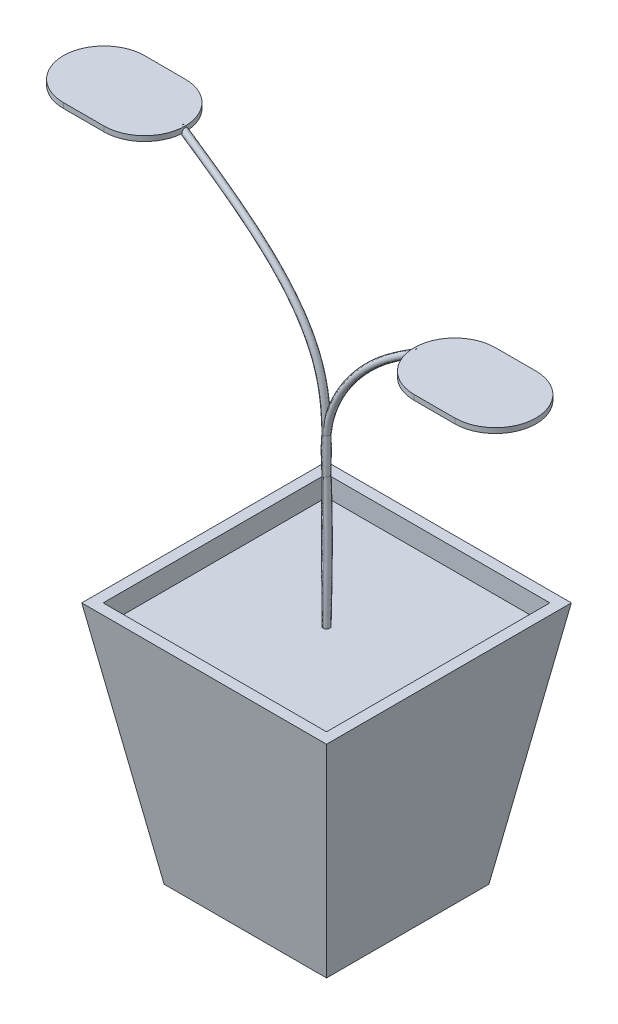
ISO-10303-21;
HEADER;
FILE_DESCRIPTION(('STEP AP214'),'2;1');
FILE_NAME('part.step','',(''),(''),'','','');
FILE_SCHEMA(('AUTOMOTIVE_DESIGN { 1 0 10303 214 1 1 1 1 }'));
ENDSEC;
DATA;
#1=APPLICATION_CONTEXT('core data for automotive mechanical design processes');
#2=APPLICATION_PROTOCOL_DEFINITION('international standard','automotive_design',2000,#1);
#3=PRODUCT_CONTEXT('',#1,'mechanical');
#4=PRODUCT('Part','Part','',(#3));
#5=PRODUCT_RELATED_PRODUCT_CATEGORY('part','',(#4));
#6=PRODUCT_DEFINITION_FORMATION('','',#4);
#7=PRODUCT_DEFINITION_CONTEXT('part definition',#1,'design');
#8=PRODUCT_DEFINITION('design','',#6,#7);
#9=PRODUCT_DEFINITION_SHAPE('','',#8);
#10=(LENGTH_UNIT() NAMED_UNIT(*) SI_UNIT(.MILLI.,.METRE.));
#11=(NAMED_UNIT(*) PLANE_ANGLE_UNIT() SI_UNIT($,.RADIAN.));
#12=(NAMED_UNIT(*) SI_UNIT($,.STERADIAN.) SOLID_ANGLE_UNIT());
#13=UNCERTAINTY_MEASURE_WITH_UNIT(LENGTH_MEASURE(1.E-05),#10,'distance_accuracy_value','');
#14=(GEOMETRIC_REPRESENTATION_CONTEXT(3) GLOBAL_UNCERTAINTY_ASSIGNED_CONTEXT((#13)) GLOBAL_UNIT_ASSIGNED_CONTEXT((#10,
#11,#12)) REPRESENTATION_CONTEXT('',''));
#15=CARTESIAN_POINT('',(0.,0.,0.));
#16=DIRECTION('',(0.,0.,1.));
#17=DIRECTION('',(1.,0.,0.));
#18=AXIS2_PLACEMENT_3D('',#15,#16,#17);
#19=CARTESIAN_POINT('',(-45.4670363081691,182.461087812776,-1.01599999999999));
#20=DIRECTION('',(0.822977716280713,-0.568073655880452,0.));
#21=DIRECTION('',(0.568073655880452,0.822977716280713,0.));
#22=AXIS2_PLACEMENT_3D('',#19,#20,#21);
#23=PLANE('',#22);
#24=DIRECTION('',(0.,0.,1.));
#25=VECTOR('',#24,1.);
#26=CARTESIAN_POINT('',(-46.0193182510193,181.660987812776,-1.01599999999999));
#27=LINE('',#26,#25);
#28=CARTESIAN_POINT('',(-46.0193182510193,181.660987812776,-0.295094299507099));
#29=VERTEX_POINT('',#28);
#30=CARTESIAN_POINT('',(-46.0193182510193,181.660987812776,0.295094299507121));
#31=VERTEX_POINT('',#30);
#32=EDGE_CURVE('E92',#29,#31,#27,.T.);
#33=ORIENTED_EDGE('',*,*,#32,.F.);
#34=CARTESIAN_POINT('',(-45.4670363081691,182.461087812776,0.));
#35=DIRECTION('',(0.822977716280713,-0.568073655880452,0.));
#36=DIRECTION('',(0.568073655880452,0.822977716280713,0.));
#37=AXIS2_PLACEMENT_3D('',#34,#35,#36);
#38=CIRCLE('',#37,1.016);
#39=EDGE_CURVE('E310',#31,#29,#38,.T.);
#40=ORIENTED_EDGE('',*,*,#39,.F.);
#41=EDGE_LOOP('',(#33,#40));
#42=FACE_BOUND('',#41,.T.);
#43=ADVANCED_FACE('F67',(#42),#23,.F.);
#44=CARTESIAN_POINT('',(0.,69.85,1.01600000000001));
#45=CARTESIAN_POINT('',(-0.0348621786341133,75.8540760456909,1.01600000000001));
#46=CARTESIAN_POINT('',(-0.104586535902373,87.8622281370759,1.01600000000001));
#47=CARTESIAN_POINT('',(-0.0935055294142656,101.83116415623,1.01600000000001));
#48=CARTESIAN_POINT('',(0.0189993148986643,114.209904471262,1.01600000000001));
#49=CARTESIAN_POINT('',(0.188707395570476,124.681488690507,1.01600000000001));
#50=CARTESIAN_POINT('',(-0.993393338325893,134.859364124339,1.01600000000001));
#51=CARTESIAN_POINT('',(-4.8145288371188,146.00642201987,1.01600000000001));
#52=CARTESIAN_POINT('',(-12.9006548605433,157.625311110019,1.01600000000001));
#53=CARTESIAN_POINT('',(-28.0203005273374,170.56717032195,1.01600000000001));
#54=CARTESIAN_POINT('',(-39.6514577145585,178.496448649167,1.01600000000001));
#55=CARTESIAN_POINT('',(-45.4670363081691,182.461087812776,1.01600000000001));
#56=CARTESIAN_POINT('',(2.03200000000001,69.85,1.01600000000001));
#57=CARTESIAN_POINT('',(1.99770498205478,75.852508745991,1.01600000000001));
#58=CARTESIAN_POINT('',(1.9291149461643,87.8575262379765,1.01600000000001));
#59=CARTESIAN_POINT('',(1.93363428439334,101.813460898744,1.01600000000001));
#60=CARTESIAN_POINT('',(2.05778730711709,114.168495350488,1.01600000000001));
#61=CARTESIAN_POINT('',(2.23188639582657,124.692216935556,1.01600000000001));
#62=CARTESIAN_POINT('',(0.991772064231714,135.290831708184,1.01600000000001));
#63=CARTESIAN_POINT('',(-2.98539091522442,146.976150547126,1.01600000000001));
#64=CARTESIAN_POINT('',(-11.4237174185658,159.050529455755,1.01600000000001));
#65=CARTESIAN_POINT('',(-26.8157585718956,172.205660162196,1.01600000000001));
#66=CARTESIAN_POINT('',(-38.4803932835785,180.157472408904,1.01600000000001));
#67=CARTESIAN_POINT('',(-44.31271063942,184.133378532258,1.01600000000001));
#68=CARTESIAN_POINT('',(2.03200000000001,69.85,-1.01599999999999));
#69=CARTESIAN_POINT('',(1.99770498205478,75.852508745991,-1.01599999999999));
#70=CARTESIAN_POINT('',(1.9291149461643,87.8575262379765,-1.01599999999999));
#71=CARTESIAN_POINT('',(1.93363428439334,101.813460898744,-1.01599999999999));
#72=CARTESIAN_POINT('',(2.05778730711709,114.168495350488,-1.01599999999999));
#73=CARTESIAN_POINT('',(2.23188639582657,124.692216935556,-1.01599999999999));
#74=CARTESIAN_POINT('',(0.991772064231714,135.290831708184,-1.01599999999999));
#75=CARTESIAN_POINT('',(-2.98539091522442,146.976150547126,-1.01599999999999));
#76=CARTESIAN_POINT('',(-11.4237174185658,159.050529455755,-1.01599999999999));
#77=CARTESIAN_POINT('',(-26.8157585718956,172.205660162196,-1.01599999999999));
#78=CARTESIAN_POINT('',(-38.4803932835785,180.157472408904,-1.01599999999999));
#79=CARTESIAN_POINT('',(-44.31271063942,184.133378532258,-1.01599999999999));
#80=CARTESIAN_POINT('',(0.,69.85,-1.01599999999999));
#81=CARTESIAN_POINT('',(-0.0348621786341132,75.8540760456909,-1.01599999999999));
#82=CARTESIAN_POINT('',(-0.104586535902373,87.8622281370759,-1.01599999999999));
#83=CARTESIAN_POINT('',(-0.0935055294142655,101.83116415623,-1.01599999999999));
#84=CARTESIAN_POINT('',(0.0189993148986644,114.209904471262,-1.01599999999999));
#85=CARTESIAN_POINT('',(0.188707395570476,124.681488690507,-1.01599999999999));
#86=CARTESIAN_POINT('',(-0.993393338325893,134.859364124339,-1.01599999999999));
#87=CARTESIAN_POINT('',(-4.8145288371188,146.00642201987,-1.01599999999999));
#88=CARTESIAN_POINT('',(-12.9006548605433,157.625311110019,-1.01599999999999));
#89=CARTESIAN_POINT('',(-28.0203005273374,170.56717032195,-1.01599999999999));
#90=CARTESIAN_POINT('',(-39.6514577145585,178.496448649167,-1.01599999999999));
#91=CARTESIAN_POINT('',(-45.4670363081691,182.461087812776,-1.01599999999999));
#92=CARTESIAN_POINT('',(-2.03199999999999,69.85,-1.01599999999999));
#93=CARTESIAN_POINT('',(-2.067429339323,75.8556433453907,-1.01599999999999));
#94=CARTESIAN_POINT('',(-2.13828801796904,87.8669300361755,-1.01599999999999));
#95=CARTESIAN_POINT('',(-2.12064534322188,101.848867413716,-1.01599999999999));
#96=CARTESIAN_POINT('',(-2.01978867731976,114.251313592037,-1.01599999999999));
#97=CARTESIAN_POINT('',(-1.85447160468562,124.670760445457,-1.01599999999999));
#98=CARTESIAN_POINT('',(-2.9785587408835,134.427896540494,-1.01599999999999));
#99=CARTESIAN_POINT('',(-6.64366675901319,145.036693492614,-1.01599999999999));
#100=CARTESIAN_POINT('',(-14.3775923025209,156.200092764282,-1.01599999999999));
#101=CARTESIAN_POINT('',(-29.2248424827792,168.928680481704,-1.01599999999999));
#102=CARTESIAN_POINT('',(-40.8225221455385,176.83542488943,-1.01599999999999));
#103=CARTESIAN_POINT('',(-46.6213619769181,180.788797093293,-1.01599999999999));
#104=CARTESIAN_POINT('',(-2.03199999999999,69.85,1.01600000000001));
#105=CARTESIAN_POINT('',(-2.067429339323,75.8556433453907,1.01600000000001));
#106=CARTESIAN_POINT('',(-2.13828801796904,87.8669300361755,1.01600000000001));
#107=CARTESIAN_POINT('',(-2.12064534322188,101.848867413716,1.01600000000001));
#108=CARTESIAN_POINT('',(-2.01978867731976,114.251313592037,1.01600000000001));
#109=CARTESIAN_POINT('',(-1.85447160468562,124.670760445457,1.01600000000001));
#110=CARTESIAN_POINT('',(-2.9785587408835,134.427896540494,1.01600000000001));
#111=CARTESIAN_POINT('',(-6.64366675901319,145.036693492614,1.01600000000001));
#112=CARTESIAN_POINT('',(-14.3775923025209,156.200092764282,1.01600000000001));
#113=CARTESIAN_POINT('',(-29.2248424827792,168.928680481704,1.01600000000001));
#114=CARTESIAN_POINT('',(-40.8225221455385,176.83542488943,1.01600000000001));
#115=CARTESIAN_POINT('',(-46.6213619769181,180.788797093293,1.01600000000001));
#116=CARTESIAN_POINT('',(0.,69.85,1.01600000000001));
#117=CARTESIAN_POINT('',(-0.0348621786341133,75.8540760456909,1.01600000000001));
#118=CARTESIAN_POINT('',(-0.104586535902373,87.8622281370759,1.01600000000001));
#119=CARTESIAN_POINT('',(-0.0935055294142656,101.83116415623,1.01600000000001));
#120=CARTESIAN_POINT('',(0.0189993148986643,114.209904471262,1.01600000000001));
#121=CARTESIAN_POINT('',(0.188707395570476,124.681488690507,1.01600000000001));
#122=CARTESIAN_POINT('',(-0.993393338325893,134.859364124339,1.01600000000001));
#123=CARTESIAN_POINT('',(-4.8145288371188,146.00642201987,1.01600000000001));
#124=CARTESIAN_POINT('',(-12.9006548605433,157.625311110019,1.01600000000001));
#125=CARTESIAN_POINT('',(-28.0203005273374,170.56717032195,1.01600000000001));
#126=CARTESIAN_POINT('',(-39.6514577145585,178.496448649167,1.01600000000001));
#127=CARTESIAN_POINT('',(-45.4670363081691,182.461087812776,1.01600000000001));
#128=(BOUNDED_SURFACE() B_SPLINE_SURFACE(3,3,((#44,#45,#46,#47,#48,#49,#50,#51,#52,#53,#54,#55),
(#56,#57,#58,#59,#60,#61,#62,#63,#64,#65,#66,#67),(#68,#69,#70,#71,#72,#73,#74,#75,#76,#77,#78,
#79),(#80,#81,#82,#83,#84,#85,#86,#87,#88,#89,#90,#91),(#92,#93,#94,#95,#96,#97,#98,#99,#100,
#101,#102,#103),(#104,#105,#106,#107,#108,#109,#110,#111,#112,#113,#114,#115),(#116,#117,#118,
#119,#120,#121,#122,#123,#124,#125,#126,#127)),.UNSPECIFIED.,.T.,.F.,
.F.) B_SPLINE_SURFACE_WITH_KNOTS((4,3,4),(4,1,1,1,1,1,1,1,1,4),(0.,0.5,1.),(0.,0.14,
0.280000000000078,0.321399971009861,0.42,0.513367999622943,0.559999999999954,0.706666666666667,
0.853333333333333,1.),
.UNSPECIFIED.) GEOMETRIC_REPRESENTATION_ITEM() RATIONAL_B_SPLINE_SURFACE(((1.,1.,1.,1.,1.,1.,1.,
1.,1.,1.,1.,1.),(0.333333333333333,0.333333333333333,0.333333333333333,0.333333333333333,
0.333333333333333,0.333333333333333,0.333333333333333,0.333333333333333,0.333333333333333,
0.333333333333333,0.333333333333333,0.333333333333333),(0.333333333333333,0.333333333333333,
0.333333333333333,0.333333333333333,0.333333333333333,0.333333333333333,0.333333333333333,
0.333333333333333,0.333333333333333,0.333333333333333,0.333333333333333,0.333333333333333),(1.,
1.,1.,1.,1.,1.,1.,1.,1.,1.,1.,1.),(0.333333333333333,0.333333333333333,0.333333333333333,
0.333333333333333,0.333333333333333,0.333333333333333,0.333333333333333,0.333333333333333,
0.333333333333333,0.333333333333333,0.333333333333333,0.333333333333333),(0.333333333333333,
0.333333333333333,0.333333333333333,0.333333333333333,0.333333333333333,0.333333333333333,
0.333333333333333,0.333333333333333,0.333333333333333,0.333333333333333,0.333333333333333,
0.333333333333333),(1.,1.,1.,1.,1.,1.,1.,1.,1.,1.,1.,1.))) REPRESENTATION_ITEM('') SURFACE());
#129=CARTESIAN_POINT('',(0.00534083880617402,122.087759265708,1.01600000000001));
#130=CARTESIAN_POINT('',(-0.000316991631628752,122.087935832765,1.0160003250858));
#131=CARTESIAN_POINT('',(-0.00597627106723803,122.088112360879,1.01595329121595));
#132=CARTESIAN_POINT('',(-0.0689354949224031,122.090075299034,1.01490433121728));
#133=CARTESIAN_POINT('',(-0.126281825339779,122.091854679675,1.00910540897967));
#134=CARTESIAN_POINT('',(-0.21091643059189,122.094468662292,0.993273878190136));
#135=CARTESIAN_POINT('',(-0.238940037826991,122.095332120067,0.986792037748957));
#136=CARTESIAN_POINT('',(-0.294369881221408,122.09703614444,0.971484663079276));
#137=CARTESIAN_POINT('',(-0.321775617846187,122.097876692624,0.962657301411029));
#138=CARTESIAN_POINT('',(-0.402623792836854,122.100350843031,0.932780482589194));
#139=CARTESIAN_POINT('',(-0.454842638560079,122.10194143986,0.908308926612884));
#140=CARTESIAN_POINT('',(-0.554419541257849,122.104962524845,0.850916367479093));
#141=CARTESIAN_POINT('',(-0.601777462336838,122.106393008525,0.81799512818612));
#142=CARTESIAN_POINT('',(-0.668090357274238,122.10838914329,0.76304554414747));
#143=CARTESIAN_POINT('',(-0.689403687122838,122.109029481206,0.743805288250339));
#144=CARTESIAN_POINT('',(-0.730311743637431,122.110256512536,0.703614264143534));
#145=CARTESIAN_POINT('',(-0.749908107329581,122.11084325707,0.682665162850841));
#146=CARTESIAN_POINT('',(-0.805947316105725,122.112518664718,0.617420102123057));
#147=CARTESIAN_POINT('',(-0.839653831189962,122.113522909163,0.570715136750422));
#148=CARTESIAN_POINT('',(-0.898590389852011,122.115275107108,0.472471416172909));
#149=CARTESIAN_POINT('',(-0.923848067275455,122.116023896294,0.420949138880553));
#150=CARTESIAN_POINT('',(-0.965334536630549,122.117252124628,0.314379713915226));
#151=CARTESIAN_POINT('',(-0.981563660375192,122.117731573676,0.259332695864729));
#152=CARTESIAN_POINT('',(-1.00448121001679,122.118408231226,0.147453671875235));
#153=CARTESIAN_POINT('',(-1.01119708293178,122.118606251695,0.0906272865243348));
#154=CARTESIAN_POINT('',(-1.01498353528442,122.11871792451,-0.0233464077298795));
#155=CARTESIAN_POINT('',(-1.01205420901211,122.118631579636,-0.0804937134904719));
#156=CARTESIAN_POINT('',(-0.99664541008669,122.118176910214,-0.193406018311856));
#157=CARTESIAN_POINT('',(-0.984178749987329,122.11780896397,-0.249172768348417));
#158=CARTESIAN_POINT('',(-0.950070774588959,122.116800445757,-0.357824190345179));
#159=CARTESIAN_POINT('',(-0.928429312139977,122.116159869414,-0.410708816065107));
#160=CARTESIAN_POINT('',(-0.876574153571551,122.114621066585,-0.512143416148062));
#161=CARTESIAN_POINT('',(-0.846353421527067,122.113722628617,-0.560689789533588));
#162=CARTESIAN_POINT('',(-0.778215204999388,122.111690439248,-0.652030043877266));
#163=CARTESIAN_POINT('',(-0.740298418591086,122.110556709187,-0.694824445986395));
#164=CARTESIAN_POINT('',(-0.657747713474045,122.108079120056,-0.773570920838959));
#165=CARTESIAN_POINT('',(-0.613096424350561,122.106734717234,-0.809504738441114));
#166=CARTESIAN_POINT('',(-0.518387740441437,122.103871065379,-0.873400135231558));
#167=CARTESIAN_POINT('',(-0.468330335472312,122.102351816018,-0.901361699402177));
#168=CARTESIAN_POINT('',(-0.390127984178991,122.099967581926,-0.936808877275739));
#169=CARTESIAN_POINT('',(-0.363423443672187,122.099151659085,-0.947573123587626));
#170=CARTESIAN_POINT('',(-0.309228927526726,122.097492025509,-0.966803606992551));
#171=CARTESIAN_POINT('',(-0.281739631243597,122.096648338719,-0.975271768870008));
#172=CARTESIAN_POINT('',(-0.198436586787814,122.094085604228,-0.997115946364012));
#173=CARTESIAN_POINT('',(-0.141645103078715,122.092330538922,-1.00699611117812));
#174=CARTESIAN_POINT('',(-0.0602669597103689,122.089803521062,-1.0141842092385));
#175=CARTESIAN_POINT('',(-0.0359586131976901,122.089047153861,-1.01545525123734));
#176=CARTESIAN_POINT('',(-0.00597763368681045,122.088112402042,-1.01595292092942));
#177=CARTESIAN_POINT('',(-0.000318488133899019,122.087935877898,-1.01599990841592));
#178=CARTESIAN_POINT('',(0.00534083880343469,122.08775926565,-1.01599999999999));
#179=B_SPLINE_CURVE_WITH_KNOTS('',3,(#129,#130,#131,#132,#133,#134,#135,#136,#137,#138,#139,
#140,#141,#142,#143,#144,#145,#146,#147,#148,#149,#150,#151,#152,#153,#154,#155,#156,#157,#158,
#159,#160,#161,#162,#163,#164,#165,#166,#167,#168,#169,#170,#171,#172,#173,#174,#175,#176,#177,
#178),.UNSPECIFIED.,.F.,.F.,(4,2,2,2,2,2,2,2,2,2,2,2,2,2,2,2,2,2,2,2,2,2,2,2,4),(0.,
0.0169856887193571,0.188949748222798,0.27520294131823,0.361523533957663,0.533726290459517,
0.705933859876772,0.79200461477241,0.8779923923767,1.04991577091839,1.22127120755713,
1.39262034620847,1.56347410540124,1.73432619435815,1.90494916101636,2.07557486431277,
2.24634090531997,2.41709146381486,2.58829022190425,2.75948930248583,2.84581028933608,
2.93205868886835,3.10409154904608,3.17710478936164,3.19409047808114),.UNSPECIFIED.);
#180=CARTESIAN_POINT('',(0.00534083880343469,122.08775926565,-1.01599999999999));
#181=VERTEX_POINT('',#180);
#182=CARTESIAN_POINT('',(0.00534083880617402,122.087759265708,1.01600000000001));
#183=VERTEX_POINT('',#182);
#184=EDGE_CURVE('E434',#181,#183,#179,.F.);
#185=CARTESIAN_POINT('',(0.00534083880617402,122.087759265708,1.01600000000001));
#186=CARTESIAN_POINT('',(0.00560608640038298,122.093414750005,1.01600000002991));
#187=CARTESIAN_POINT('',(0.00587194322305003,122.099070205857,1.01599975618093));
#188=CARTESIAN_POINT('',(0.011643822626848,122.221571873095,1.01598911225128));
#189=CARTESIAN_POINT('',(0.0174089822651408,122.338405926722,1.01587329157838));
#190=CARTESIAN_POINT('',(0.0354643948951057,122.688876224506,1.0151119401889));
#191=CARTESIAN_POINT('',(0.0485142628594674,122.92247316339,1.01405250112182));
#192=CARTESIAN_POINT('',(0.0765322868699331,123.389556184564,1.0102126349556));
#193=CARTESIAN_POINT('',(0.0915005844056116,123.623042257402,1.00743208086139));
#194=CARTESIAN_POINT('',(0.123255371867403,124.090035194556,0.999383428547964));
#195=CARTESIAN_POINT('',(0.140043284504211,124.323541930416,0.994113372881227));
#196=CARTESIAN_POINT('',(0.175311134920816,124.790323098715,0.980126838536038));
#197=CARTESIAN_POINT('',(0.193791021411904,125.023597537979,0.971410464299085));
#198=CARTESIAN_POINT('',(0.232328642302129,125.489885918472,0.94926474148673));
#199=CARTESIAN_POINT('',(0.252386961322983,125.722899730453,0.935833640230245));
#200=CARTESIAN_POINT('',(0.293936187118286,126.188325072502,0.902525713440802));
#201=CARTESIAN_POINT('',(0.315426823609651,126.420736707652,0.882650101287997));
#202=CARTESIAN_POINT('',(0.3486267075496,126.768724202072,0.845915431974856));
#203=CARTESIAN_POINT('',(0.359863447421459,126.884708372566,0.83250337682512));
#204=CARTESIAN_POINT('',(0.382627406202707,127.116309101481,0.802833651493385));
#205=CARTESIAN_POINT('',(0.394154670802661,127.231925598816,0.786575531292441));
#206=CARTESIAN_POINT('',(0.417449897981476,127.462469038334,0.750512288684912));
#207=CARTESIAN_POINT('',(0.429217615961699,127.577396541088,0.730710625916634));
#208=CARTESIAN_POINT('',(0.452949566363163,127.806324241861,0.686491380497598));
#209=CARTESIAN_POINT('',(0.464913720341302,127.920324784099,0.66207560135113));
#210=CARTESIAN_POINT('',(0.482949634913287,128.090240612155,0.620601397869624));
#211=CARTESIAN_POINT('',(0.488981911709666,128.146747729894,0.605953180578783));
#212=CARTESIAN_POINT('',(0.501055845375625,128.259236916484,0.574663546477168));
#213=CARTESIAN_POINT('',(0.50709750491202,128.315218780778,0.558021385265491));
#214=CARTESIAN_POINT('',(0.519173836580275,128.426539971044,0.522186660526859));
#215=CARTESIAN_POINT('',(0.525208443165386,128.481877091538,0.502987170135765));
#216=CARTESIAN_POINT('',(0.537198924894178,128.591290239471,0.461299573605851));
#217=CARTESIAN_POINT('',(0.543154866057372,128.645367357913,0.438814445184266));
#218=CARTESIAN_POINT('',(0.551980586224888,128.725136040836,0.401479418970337));
#219=CARTESIAN_POINT('',(0.554918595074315,128.751627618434,0.388359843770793));
#220=CARTESIAN_POINT('',(0.560721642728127,128.803837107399,0.360657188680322));
#221=CARTESIAN_POINT('',(0.563586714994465,128.829555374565,0.346074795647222));
#222=CARTESIAN_POINT('',(0.56919098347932,128.879757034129,0.31514495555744));
#223=CARTESIAN_POINT('',(0.571930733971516,128.904245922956,0.298806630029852));
#224=CARTESIAN_POINT('',(0.577227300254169,128.951497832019,0.263796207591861));
#225=CARTESIAN_POINT('',(0.579784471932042,128.974264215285,0.245128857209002));
#226=CARTESIAN_POINT('',(0.583948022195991,129.011270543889,0.210093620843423));
#227=CARTESIAN_POINT('',(0.585626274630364,129.026166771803,0.194436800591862));
#228=CARTESIAN_POINT('',(0.58871888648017,129.053588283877,0.161133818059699));
#229=CARTESIAN_POINT('',(0.590133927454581,129.06611969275,0.143492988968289));
#230=CARTESIAN_POINT('',(0.592133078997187,129.083810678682,0.112527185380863));
#231=CARTESIAN_POINT('',(0.592835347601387,129.090021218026,0.0998176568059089));
#232=CARTESIAN_POINT('',(0.594006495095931,129.100374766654,0.0735830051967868));
#233=CARTESIAN_POINT('',(0.594475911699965,129.10452253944,0.0600598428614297));
#234=CARTESIAN_POINT('',(0.595134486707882,129.110340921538,0.0323213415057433));
#235=CARTESIAN_POINT('',(0.595320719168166,129.11198566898,0.0181003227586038));
#236=CARTESIAN_POINT('',(0.595376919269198,129.11248206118,-0.0103900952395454));
#237=CARTESIAN_POINT('',(0.595246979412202,129.111334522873,-0.0246594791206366));
#238=CARTESIAN_POINT('',(0.594724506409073,129.106718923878,-0.050994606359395));
#239=CARTESIAN_POINT('',(0.594366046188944,129.10355195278,-0.063116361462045));
#240=CARTESIAN_POINT('',(0.593453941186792,129.095490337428,-0.0867755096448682));
#241=CARTESIAN_POINT('',(0.59289992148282,129.090592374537,-0.0983117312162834));
#242=CARTESIAN_POINT('',(0.591227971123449,129.075803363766,-0.127883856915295));
#243=CARTESIAN_POINT('',(0.589976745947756,129.064728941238,-0.145315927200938));
#244=CARTESIAN_POINT('',(0.587198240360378,129.040109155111,-0.178302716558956));
#245=CARTESIAN_POINT('',(0.58567016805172,129.026556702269,-0.193851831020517));
#246=CARTESIAN_POINT('',(0.582460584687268,128.99805523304,-0.223092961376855));
#247=CARTESIAN_POINT('',(0.58078183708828,128.98313128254,-0.236810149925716));
#248=CARTESIAN_POINT('',(0.577310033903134,128.952226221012,-0.262915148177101));
#249=CARTESIAN_POINT('',(0.575517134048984,128.936246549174,-0.275304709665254));
#250=CARTESIAN_POINT('',(0.571844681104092,128.903469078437,-0.299037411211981));
#251=CARTESIAN_POINT('',(0.569964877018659,128.886668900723,-0.310377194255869));
#252=CARTESIAN_POINT('',(0.566146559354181,128.852493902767,-0.332145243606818));
#253=CARTESIAN_POINT('',(0.564208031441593,128.835118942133,-0.342573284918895));
#254=CARTESIAN_POINT('',(0.558827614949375,128.786821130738,-0.37014614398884));
#255=CARTESIAN_POINT('',(0.555342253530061,128.755453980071,-0.386503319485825));
#256=CARTESIAN_POINT('',(0.548293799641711,128.691842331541,-0.417406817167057));
#257=CARTESIAN_POINT('',(0.54473066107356,128.659597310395,-0.431952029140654));
#258=CARTESIAN_POINT('',(0.533961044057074,128.56185175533,-0.473470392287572));
#259=CARTESIAN_POINT('',(0.526685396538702,128.495439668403,-0.49827351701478));
#260=CARTESIAN_POINT('',(0.512046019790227,128.360972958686,-0.544000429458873));
#261=CARTESIAN_POINT('',(0.504682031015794,128.292911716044,-0.564903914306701));
#262=CARTESIAN_POINT('',(0.489969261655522,128.156026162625,-0.603657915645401));
#263=CARTESIAN_POINT('',(0.482620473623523,128.087202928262,-0.621512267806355));
#264=CARTESIAN_POINT('',(0.463726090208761,127.909015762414,-0.664511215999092));
#265=CARTESIAN_POINT('',(0.452211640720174,127.799228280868,-0.687899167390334));
#266=CARTESIAN_POINT('',(0.429365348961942,127.578798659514,-0.730401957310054));
#267=CARTESIAN_POINT('',(0.418033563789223,127.468156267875,-0.749515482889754));
#268=CARTESIAN_POINT('',(0.395578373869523,127.246096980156,-0.784456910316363));
#269=CARTESIAN_POINT('',(0.384455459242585,127.134678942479,-0.800277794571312));
#270=CARTESIAN_POINT('',(0.36247509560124,126.911466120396,-0.829240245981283));
#271=CARTESIAN_POINT('',(0.351617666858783,126.799671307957,-0.842381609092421));
#272=CARTESIAN_POINT('',(0.319463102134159,126.463685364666,-0.87854566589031));
#273=CARTESIAN_POINT('',(0.298604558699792,126.239098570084,-0.898277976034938));
#274=CARTESIAN_POINT('',(0.25823073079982,125.789529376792,-0.931534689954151));
#275=CARTESIAN_POINT('',(0.238714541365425,125.564547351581,-0.945063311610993));
#276=CARTESIAN_POINT('',(0.201159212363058,125.114542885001,-0.96754340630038));
#277=CARTESIAN_POINT('',(0.183118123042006,124.889520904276,-0.976501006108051));
#278=CARTESIAN_POINT('',(0.148597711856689,124.439298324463,-0.991047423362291));
#279=CARTESIAN_POINT('',(0.132118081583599,124.214097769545,-0.996636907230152));
#280=CARTESIAN_POINT('',(0.108226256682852,123.870140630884,-1.00328413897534));
#281=CARTESIAN_POINT('',(0.10021345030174,123.751441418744,-1.00523471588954));
#282=CARTESIAN_POINT('',(0.0846628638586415,123.513985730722,-1.00855766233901));
#283=CARTESIAN_POINT('',(0.0771251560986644,123.39522924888,-1.00992994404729));
#284=CARTESIAN_POINT('',(0.0552591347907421,123.039078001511,-1.01332967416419));
#285=CARTESIAN_POINT('',(0.0416660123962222,122.801630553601,-1.01464301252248));
#286=CARTESIAN_POINT('',(0.0250642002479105,122.487575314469,-1.01556640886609));
#287=CARTESIAN_POINT('',(0.0211252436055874,122.411016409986,-1.01572759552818));
#288=CARTESIAN_POINT('',(0.0134664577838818,122.257881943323,-1.01594070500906));
#289=CARTESIAN_POINT('',(0.0097466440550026,122.18130638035,-1.0159926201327));
#290=CARTESIAN_POINT('',(0.00587194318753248,122.099070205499,-1.01599975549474));
#291=CARTESIAN_POINT('',(0.00560608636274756,122.093414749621,-1.01599999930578));
#292=CARTESIAN_POINT('',(0.00534083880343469,122.08775926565,-1.01599999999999));
#293=B_SPLINE_CURVE_WITH_KNOTS('',3,(#185,#186,#187,#188,#189,#190,#191,#192,#193,#194,#195,
#196,#197,#198,#199,#200,#201,#202,#203,#204,#205,#206,#207,#208,#209,#210,#211,#212,#213,#214,
#215,#216,#217,#218,#219,#220,#221,#222,#223,#224,#225,#226,#227,#228,#229,#230,#231,#232,#233,
#234,#235,#236,#237,#238,#239,#240,#241,#242,#243,#244,#245,#246,#247,#248,#249,#250,#251,#252,
#253,#254,#255,#256,#257,#258,#259,#260,#261,#262,#263,#264,#265,#266,#267,#268,#269,#270,#271,
#272,#273,#274,#275,#276,#277,#278,#279,#280,#281,#282,#283,#284,#285,#286,#287,#288,#289,#290,
#291,#292),.UNSPECIFIED.,.F.,.F.,(4,2,2,2,2,2,2,2,2,2,2,2,2,2,2,2,2,2,2,2,2,2,2,2,2,2,2,2,2,2,2,
2,2,2,2,2,2,2,2,2,2,2,2,2,2,2,2,2,2,2,2,2,2,4),(0.,0.0169851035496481,0.367912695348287,
1.06979022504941,1.77171955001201,2.47420170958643,3.17666258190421,3.87938486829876,
4.58197492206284,4.9338382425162,5.28575724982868,5.63733452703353,5.98877466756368,
6.16480540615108,6.34090206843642,6.51748579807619,6.69391047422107,6.78300079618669,
6.87204948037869,6.96065610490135,7.04908501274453,7.11396987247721,7.17868430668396,
7.22103346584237,7.26328436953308,7.3059689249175,7.34864099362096,7.38609220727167,
7.42361561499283,7.48532716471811,7.54721810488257,7.60814418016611,7.66898884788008,
7.73002181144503,7.79106979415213,7.89762492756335,8.00424503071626,8.21782187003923,
8.4324813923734,8.64686886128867,8.98526140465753,9.32375774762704,9.66296830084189,
10.0022046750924,10.6813042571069,11.359941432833,12.0376665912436,12.7152576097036,
13.0722116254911,13.4292198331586,14.1427223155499,14.3727032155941,14.602700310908,
14.6196854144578),.UNSPECIFIED.);
#294=EDGE_CURVE('E440',#183,#181,#293,.T.);
#295=CARTESIAN_POINT('',(-46.0193182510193,181.660987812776,-0.295094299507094));
#296=CARTESIAN_POINT('',(-46.0051592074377,181.660987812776,-0.321363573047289));
#297=CARTESIAN_POINT('',(-45.9894372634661,181.660987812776,-0.346720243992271));
#298=CARTESIAN_POINT('',(-45.9554274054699,181.660987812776,-0.395537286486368));
#299=CARTESIAN_POINT('',(-45.9371479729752,181.660987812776,-0.419003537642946));
#300=CARTESIAN_POINT('',(-45.8797330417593,181.660987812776,-0.486029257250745));
#301=CARTESIAN_POINT('',(-45.8375661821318,181.660987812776,-0.526999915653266));
#302=CARTESIAN_POINT('',(-45.7603840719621,181.660987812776,-0.592022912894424));
#303=CARTESIAN_POINT('',(-45.7266149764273,181.660987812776,-0.617620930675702));
#304=CARTESIAN_POINT('',(-45.6569687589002,181.660987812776,-0.665776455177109));
#305=CARTESIAN_POINT('',(-45.6210912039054,181.660987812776,-0.688333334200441));
#306=CARTESIAN_POINT('',(-45.5104856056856,181.660987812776,-0.752206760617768));
#307=CARTESIAN_POINT('',(-45.4333119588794,181.660987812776,-0.789305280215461));
#308=CARTESIAN_POINT('',(-45.2882834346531,181.660987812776,-0.84871127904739));
#309=CARTESIAN_POINT('',(-45.2209882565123,181.660987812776,-0.872448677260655));
#310=CARTESIAN_POINT('',(-45.0845730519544,181.660987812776,-0.914094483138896));
#311=CARTESIAN_POINT('',(-45.0154518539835,181.660987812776,-0.931999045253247));
#312=CARTESIAN_POINT('',(-44.8761792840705,181.660987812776,-0.962434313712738));
#313=CARTESIAN_POINT('',(-44.8060299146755,181.660987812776,-0.974974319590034));
#314=CARTESIAN_POINT('',(-44.6650159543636,181.660987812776,-0.995057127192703));
#315=CARTESIAN_POINT('',(-44.5941512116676,181.660987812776,-1.00259884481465));
#316=CARTESIAN_POINT('',(-44.4305923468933,181.660987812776,-1.01442636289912));
#317=CARTESIAN_POINT('',(-44.3377706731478,181.660987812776,-1.01704038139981));
#318=CARTESIAN_POINT('',(-44.1988470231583,181.660987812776,-1.01492971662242));
#319=CARTESIAN_POINT('',(-44.1526775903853,181.660987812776,-1.01322975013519));
#320=CARTESIAN_POINT('',(-44.0604519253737,181.660987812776,-1.00780805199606));
#321=CARTESIAN_POINT('',(-44.0143957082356,181.660987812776,-1.00408606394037));
#322=CARTESIAN_POINT('',(-43.9684363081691,181.660987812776,-0.999340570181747));
#323=B_SPLINE_CURVE_WITH_KNOTS('',3,(#295,#296,#297,#298,#299,#300,#301,#302,#303,#304,#305,
#306,#307,#308,#309,#310,#311,#312,#313,#314,#315,#316,#317,#318,#319,#320,#321,#322),
.UNSPECIFIED.,.F.,.F.,(4,2,2,2,2,2,2,2,2,2,2,2,2,4),(0.,0.0893764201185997,0.178463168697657,
0.353963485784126,0.480939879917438,0.607942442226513,0.863948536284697,1.07777324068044,
1.29173863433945,1.50533159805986,1.71897087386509,1.99714726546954,2.13571264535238,
2.27429560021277),.UNSPECIFIED.);
#324=CARTESIAN_POINT('',(-44.2377023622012,181.660987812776,-1.01551171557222));
#325=VERTEX_POINT('',#324);
#326=EDGE_CURVE('E80',#29,#325,#323,.T.);
#327=CARTESIAN_POINT('',(-44.237702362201,181.660987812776,-1.01551171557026));
#328=CARTESIAN_POINT('',(-44.2375608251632,181.746274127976,-1.01335126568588));
#329=CARTESIAN_POINT('',(-44.2367618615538,181.831626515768,-1.00375650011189));
#330=CARTESIAN_POINT('',(-44.2340530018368,181.999510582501,-0.969215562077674));
#331=CARTESIAN_POINT('',(-44.2321381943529,182.082028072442,-0.944201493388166));
#332=CARTESIAN_POINT('',(-44.2279611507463,182.221901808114,-0.886069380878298));
#333=CARTESIAN_POINT('',(-44.2258855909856,182.280621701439,-0.856225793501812));
#334=CARTESIAN_POINT('',(-44.2214164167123,182.3922811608,-0.787312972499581));
#335=CARTESIAN_POINT('',(-44.2190233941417,182.445231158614,-0.748260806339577));
#336=CARTESIAN_POINT('',(-44.2141696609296,182.543725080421,-0.660919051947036));
#337=CARTESIAN_POINT('',(-44.211708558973,182.589205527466,-0.612557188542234));
#338=CARTESIAN_POINT('',(-44.2070848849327,182.669829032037,-0.507802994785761));
#339=CARTESIAN_POINT('',(-44.2049221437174,182.704977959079,-0.451415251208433));
#340=CARTESIAN_POINT('',(-44.2015025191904,182.758702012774,-0.340669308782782));
#341=CARTESIAN_POINT('',(-44.2001620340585,182.778890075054,-0.287095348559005));
#342=CARTESIAN_POINT('',(-44.1981524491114,182.808748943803,-0.177090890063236));
#343=CARTESIAN_POINT('',(-44.1974827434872,182.81842924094,-0.120663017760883));
#344=CARTESIAN_POINT('',(-44.1969420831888,182.826253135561,-0.0132360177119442));
#345=CARTESIAN_POINT('',(-44.1969918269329,182.825542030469,0.0376823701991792));
#346=CARTESIAN_POINT('',(-44.1976926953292,182.815376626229,0.138625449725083));
#347=CARTESIAN_POINT('',(-44.1983436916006,182.805924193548,0.188650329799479));
#348=CARTESIAN_POINT('',(-44.200149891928,182.779052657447,0.285234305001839));
#349=CARTESIAN_POINT('',(-44.2012930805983,182.761822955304,0.331846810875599));
#350=CARTESIAN_POINT('',(-44.2039607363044,182.720200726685,0.421731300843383));
#351=CARTESIAN_POINT('',(-44.2054852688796,182.695806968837,0.465002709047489));
#352=CARTESIAN_POINT('',(-44.208863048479,182.639215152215,0.549689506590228));
#353=CARTESIAN_POINT('',(-44.2107300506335,182.606652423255,0.59085975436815));
#354=CARTESIAN_POINT('',(-44.2145494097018,182.535740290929,0.6678434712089));
#355=CARTESIAN_POINT('',(-44.2165017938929,182.497389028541,0.703655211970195));
#356=CARTESIAN_POINT('',(-44.220551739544,182.411330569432,0.773368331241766));
#357=CARTESIAN_POINT('',(-44.2226398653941,182.363054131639,0.806566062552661));
#358=CARTESIAN_POINT('',(-44.2265363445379,182.262180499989,0.865625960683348));
#359=CARTESIAN_POINT('',(-44.2283444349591,182.209579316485,0.891481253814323));
#360=CARTESIAN_POINT('',(-44.2317849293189,182.093214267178,0.939182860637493));
#361=CARTESIAN_POINT('',(-44.2333499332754,182.02896188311,0.9598401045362));
#362=CARTESIAN_POINT('',(-44.2357965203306,181.898202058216,0.991599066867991));
#363=CARTESIAN_POINT('',(-44.2366786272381,181.831696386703,1.0027081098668));
#364=CARTESIAN_POINT('',(-44.2374629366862,181.730255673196,1.01251847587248));
#365=CARTESIAN_POINT('',(-44.2376328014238,181.695626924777,1.01462313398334));
#366=CARTESIAN_POINT('',(-44.237702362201,181.660987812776,1.01551171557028));
#367=B_SPLINE_CURVE_WITH_KNOTS('',3,(#327,#328,#329,#330,#331,#332,#333,#334,#335,#336,#337,
#338,#339,#340,#341,#342,#343,#344,#345,#346,#347,#348,#349,#350,#351,#352,#353,#354,#355,#356,
#357,#358,#359,#360,#361,#362,#363,#364,#365,#366),.UNSPECIFIED.,.F.,.F.,(4,2,2,2,2,2,2,2,2,2,2,
2,2,2,2,2,2,2,2,4),(0.,0.256051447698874,0.513238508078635,0.710134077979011,0.906667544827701,
1.1047932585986,1.30280619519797,1.47363323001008,1.64430584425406,1.79632427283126,
1.94831024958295,2.09677943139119,2.24527414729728,2.40220590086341,2.55918816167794,
2.73438285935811,2.90974103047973,3.11149193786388,3.31308794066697,3.4170677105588),.UNSPECIFIED.);
#368=CARTESIAN_POINT('',(-44.237702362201,181.660987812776,1.01551171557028));
#369=VERTEX_POINT('',#368);
#370=EDGE_CURVE('E479',#325,#369,#367,.T.);
#371=CARTESIAN_POINT('',(-43.9684363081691,181.660987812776,0.999340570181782));
#372=CARTESIAN_POINT('',(-44.0529177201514,181.660987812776,1.00802674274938));
#373=CARTESIAN_POINT('',(-44.1377431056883,181.660987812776,1.01331761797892));
#374=CARTESIAN_POINT('',(-44.3076731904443,181.660987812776,1.01711135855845));
#375=CARTESIAN_POINT('',(-44.3927781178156,181.660987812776,1.01560401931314));
#376=CARTESIAN_POINT('',(-44.5632080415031,181.660987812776,1.00574273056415));
#377=CARTESIAN_POINT('',(-44.6485302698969,181.660987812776,0.997339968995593));
#378=CARTESIAN_POINT('',(-44.8180866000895,181.660987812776,0.973320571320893));
#379=CARTESIAN_POINT('',(-44.9023215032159,181.660987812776,0.957709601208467));
#380=CARTESIAN_POINT('',(-45.0795508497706,181.660987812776,0.916218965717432));
#381=CARTESIAN_POINT('',(-45.1723113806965,181.660987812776,0.889293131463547));
#382=CARTESIAN_POINT('',(-45.3083859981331,181.660987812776,0.840416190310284));
#383=CARTESIAN_POINT('',(-45.3532403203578,181.660987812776,0.822705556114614));
#384=CARTESIAN_POINT('',(-45.4415916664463,181.660987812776,0.784182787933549));
#385=CARTESIAN_POINT('',(-45.4850890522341,181.660987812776,0.763371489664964));
#386=CARTESIAN_POINT('',(-45.5885094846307,181.660987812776,0.708704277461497));
#387=CARTESIAN_POINT('',(-45.6475158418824,181.660987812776,0.673072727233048));
#388=CARTESIAN_POINT('',(-45.759603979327,181.660987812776,0.593876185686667));
#389=CARTESIAN_POINT('',(-45.8127191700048,181.660987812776,0.550360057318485));
#390=CARTESIAN_POINT('',(-45.8921286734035,181.660987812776,0.471683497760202));
#391=CARTESIAN_POINT('',(-45.9211259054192,181.660987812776,0.43929105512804));
#392=CARTESIAN_POINT('',(-45.9743182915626,181.660987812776,0.370331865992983));
#393=CARTESIAN_POINT('',(-45.9984664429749,181.660987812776,0.333729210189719));
#394=CARTESIAN_POINT('',(-46.0193182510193,181.660987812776,0.295094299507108));
#395=B_SPLINE_CURVE_WITH_KNOTS('',3,(#371,#372,#373,#374,#375,#376,#377,#378,#379,#380,#381,
#382,#383,#384,#385,#386,#387,#388,#389,#390,#391,#392,#393,#394),.UNSPECIFIED.,.F.,.F.,(4,2,2,
2,2,2,2,2,2,2,2,4),(0.,0.254703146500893,0.509788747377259,0.766695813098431,1.02340128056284,
1.3124578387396,1.4570338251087,1.60157091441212,1.8078226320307,2.01283734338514,
2.14284348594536,2.2740546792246),.UNSPECIFIED.);
#396=EDGE_CURVE('E472',#369,#31,#395,.T.);
#397=ORIENTED_EDGE('',*,*,#184,.T.);
#398=ORIENTED_EDGE('',*,*,#294,.T.);
#399=EDGE_LOOP('',(#397,#398));
#400=FACE_BOUND('',#399,.T.);
#401=ORIENTED_EDGE('',*,*,#39,.T.);
#402=ORIENTED_EDGE('',*,*,#326,.T.);
#403=ORIENTED_EDGE('',*,*,#370,.T.);
#404=ORIENTED_EDGE('',*,*,#396,.T.);
#405=EDGE_LOOP('',(#401,#402,#403,#404));
#406=FACE_BOUND('',#405,.T.);
#407=ADVANCED_FACE('F413',(#400,#406),#128,.T.);
#408=CARTESIAN_POINT('',(28.6911204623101,158.236908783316,-1.01599999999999));
#409=DIRECTION('',(-0.834733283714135,-0.550654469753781,0.));
#410=DIRECTION('',(0.550654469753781,-0.834733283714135,0.));
#411=AXIS2_PLACEMENT_3D('',#408,#409,#410);
#412=PLANE('',#411);
#413=DIRECTION('',(0.,0.,-1.));
#414=VECTOR('',#413,1.);
#415=CARTESIAN_POINT('',(29.2189281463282,157.436808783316,-1.01599999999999));
#416=LINE('',#415,#414);
#417=CARTESIAN_POINT('',(29.2189281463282,157.436808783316,0.336919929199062));
#418=VERTEX_POINT('',#417);
#419=CARTESIAN_POINT('',(29.2189281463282,157.436808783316,-0.336919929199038));
#420=VERTEX_POINT('',#419);
#421=EDGE_CURVE('E303',#418,#420,#416,.T.);
#422=ORIENTED_EDGE('',*,*,#421,.F.);
#423=CARTESIAN_POINT('',(28.6911204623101,158.236908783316,0.));
#424=DIRECTION('',(-0.834733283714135,-0.550654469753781,0.));
#425=DIRECTION('',(0.550654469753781,-0.834733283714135,0.));
#426=AXIS2_PLACEMENT_3D('',#423,#424,#425);
#427=CIRCLE('',#426,1.016);
#428=EDGE_CURVE('E311',#420,#418,#427,.T.);
#429=ORIENTED_EDGE('',*,*,#428,.F.);
#430=EDGE_LOOP('',(#422,#429));
#431=FACE_BOUND('',#430,.T.);
#432=ADVANCED_FACE('F616',(#431),#412,.F.);
#433=CARTESIAN_POINT('',(0.,69.85,1.01600000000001));
#434=CARTESIAN_POINT('',(0.111465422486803,74.4652921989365,1.01600000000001));
#435=CARTESIAN_POINT('',(0.334396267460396,83.6958765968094,1.01600000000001));
#436=CARTESIAN_POINT('',(0.436563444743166,97.3381729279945,1.01600000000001));
#437=CARTESIAN_POINT('',(0.206119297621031,106.620502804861,1.01600000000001));
#438=CARTESIAN_POINT('',(-0.195970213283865,114.807926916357,1.01600000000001));
#439=CARTESIAN_POINT('',(-0.471247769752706,119.697445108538,1.01600000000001));
#440=CARTESIAN_POINT('',(0.941679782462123,127.800493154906,1.01600000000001));
#441=CARTESIAN_POINT('',(4.18484102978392,135.723705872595,1.01600000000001));
#442=CARTESIAN_POINT('',(10.6479234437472,144.423496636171,1.01600000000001));
#443=CARTESIAN_POINT('',(16.2157083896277,149.590690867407,1.01600000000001));
#444=CARTESIAN_POINT('',(22.0603751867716,154.088984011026,1.01600000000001));
#445=CARTESIAN_POINT('',(25.6303461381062,156.322212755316,1.01600000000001));
#446=CARTESIAN_POINT('',(28.6911204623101,158.236908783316,1.01600000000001));
#447=CARTESIAN_POINT('',(2.03200000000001,69.85,1.01600000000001));
#448=CARTESIAN_POINT('',(2.14325237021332,74.4723838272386,1.01600000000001));
#449=CARTESIAN_POINT('',(2.36575711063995,83.7171514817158,1.01600000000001));
#450=CARTESIAN_POINT('',(2.47065056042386,97.35477964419,1.01600000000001));
#451=CARTESIAN_POINT('',(2.22935176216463,106.833018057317,1.01600000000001));
#452=CARTESIAN_POINT('',(1.83268372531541,114.915601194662,1.01600000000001));
#453=CARTESIAN_POINT('',(1.56838910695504,119.599515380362,1.01600000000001));
#454=CARTESIAN_POINT('',(2.91738504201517,127.263665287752,1.01600000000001));
#455=CARTESIAN_POINT('',(5.97691298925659,134.718552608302,1.01600000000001));
#456=CARTESIAN_POINT('',(12.2111160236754,143.104861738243,1.01600000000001));
#457=CARTESIAN_POINT('',(17.5622635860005,148.070109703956,1.01600000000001));
#458=CARTESIAN_POINT('',(23.2503411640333,152.435300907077,1.01600000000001));
#459=CARTESIAN_POINT('',(26.7820665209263,154.645650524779,1.01600000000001));
#460=CARTESIAN_POINT('',(29.8100503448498,156.540730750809,1.01600000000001));
#461=CARTESIAN_POINT('',(2.03200000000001,69.85,-1.01599999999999));
#462=CARTESIAN_POINT('',(2.14325237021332,74.4723838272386,-1.01599999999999));
#463=CARTESIAN_POINT('',(2.36575711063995,83.7171514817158,-1.01599999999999));
#464=CARTESIAN_POINT('',(2.47065056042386,97.35477964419,-1.01599999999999));
#465=CARTESIAN_POINT('',(2.22935176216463,106.833018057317,-1.01599999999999));
#466=CARTESIAN_POINT('',(1.83268372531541,114.915601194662,-1.01599999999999));
#467=CARTESIAN_POINT('',(1.56838910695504,119.599515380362,-1.01599999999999));
#468=CARTESIAN_POINT('',(2.91738504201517,127.263665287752,-1.01599999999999));
#469=CARTESIAN_POINT('',(5.97691298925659,134.718552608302,-1.01599999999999));
#470=CARTESIAN_POINT('',(12.2111160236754,143.104861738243,-1.01599999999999));
#471=CARTESIAN_POINT('',(17.5622635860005,148.070109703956,-1.01599999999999));
#472=CARTESIAN_POINT('',(23.2503411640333,152.435300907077,-1.01599999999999));
#473=CARTESIAN_POINT('',(26.7820665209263,154.645650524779,-1.01599999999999));
#474=CARTESIAN_POINT('',(29.8100503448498,156.540730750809,-1.01599999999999));
#475=CARTESIAN_POINT('',(0.,69.85,-1.01599999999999));
#476=CARTESIAN_POINT('',(0.111465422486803,74.4652921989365,-1.01599999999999));
#477=CARTESIAN_POINT('',(0.334396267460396,83.6958765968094,-1.01599999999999));
#478=CARTESIAN_POINT('',(0.436563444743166,97.3381729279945,-1.01599999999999));
#479=CARTESIAN_POINT('',(0.206119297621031,106.620502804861,-1.01599999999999));
#480=CARTESIAN_POINT('',(-0.195970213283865,114.807926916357,-1.01599999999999));
#481=CARTESIAN_POINT('',(-0.471247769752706,119.697445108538,-1.01599999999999));
#482=CARTESIAN_POINT('',(0.941679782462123,127.800493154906,-1.01599999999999));
#483=CARTESIAN_POINT('',(4.18484102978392,135.723705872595,-1.01599999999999));
#484=CARTESIAN_POINT('',(10.6479234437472,144.423496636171,-1.01599999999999));
#485=CARTESIAN_POINT('',(16.2157083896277,149.590690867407,-1.01599999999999));
#486=CARTESIAN_POINT('',(22.0603751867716,154.088984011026,-1.01599999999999));
#487=CARTESIAN_POINT('',(25.6303461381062,156.322212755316,-1.01599999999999));
#488=CARTESIAN_POINT('',(28.6911204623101,158.236908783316,-1.01599999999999));
#489=CARTESIAN_POINT('',(-2.03199999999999,69.85,-1.01599999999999));
#490=CARTESIAN_POINT('',(-1.92032152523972,74.4582005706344,-1.01599999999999));
#491=CARTESIAN_POINT('',(-1.69696457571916,83.674601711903,-1.01599999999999));
#492=CARTESIAN_POINT('',(-1.59752367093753,97.3215662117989,-1.01599999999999));
#493=CARTESIAN_POINT('',(-1.81711316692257,106.407987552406,-1.01599999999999));
#494=CARTESIAN_POINT('',(-2.22462415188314,114.700252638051,-1.01599999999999));
#495=CARTESIAN_POINT('',(-2.51088464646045,119.795374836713,-1.01599999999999));
#496=CARTESIAN_POINT('',(-1.03402547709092,128.337321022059,-1.01599999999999));
#497=CARTESIAN_POINT('',(2.39276907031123,136.728859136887,-1.01599999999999));
#498=CARTESIAN_POINT('',(9.08473086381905,145.742131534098,-1.01599999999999));
#499=CARTESIAN_POINT('',(14.8691531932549,151.111272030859,-1.01599999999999));
#500=CARTESIAN_POINT('',(20.8704092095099,155.742667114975,-1.01599999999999));
#501=CARTESIAN_POINT('',(24.4786257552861,157.998774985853,-1.01599999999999));
#502=CARTESIAN_POINT('',(27.5721905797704,159.933086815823,-1.01599999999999));
#503=CARTESIAN_POINT('',(-2.03199999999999,69.85,1.01600000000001));
#504=CARTESIAN_POINT('',(-1.92032152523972,74.4582005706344,1.01600000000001));
#505=CARTESIAN_POINT('',(-1.69696457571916,83.674601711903,1.01600000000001));
#506=CARTESIAN_POINT('',(-1.59752367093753,97.3215662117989,1.01600000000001));
#507=CARTESIAN_POINT('',(-1.81711316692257,106.407987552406,1.01600000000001));
#508=CARTESIAN_POINT('',(-2.22462415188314,114.700252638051,1.01600000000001));
#509=CARTESIAN_POINT('',(-2.51088464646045,119.795374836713,1.01600000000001));
#510=CARTESIAN_POINT('',(-1.03402547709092,128.337321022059,1.01600000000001));
#511=CARTESIAN_POINT('',(2.39276907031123,136.728859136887,1.01600000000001));
#512=CARTESIAN_POINT('',(9.08473086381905,145.742131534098,1.01600000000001));
#513=CARTESIAN_POINT('',(14.8691531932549,151.111272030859,1.01600000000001));
#514=CARTESIAN_POINT('',(20.8704092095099,155.742667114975,1.01600000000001));
#515=CARTESIAN_POINT('',(24.4786257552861,157.998774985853,1.01600000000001));
#516=CARTESIAN_POINT('',(27.5721905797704,159.933086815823,1.01600000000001));
#517=CARTESIAN_POINT('',(0.,69.85,1.01600000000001));
#518=CARTESIAN_POINT('',(0.111465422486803,74.4652921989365,1.01600000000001));
#519=CARTESIAN_POINT('',(0.334396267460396,83.6958765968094,1.01600000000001));
#520=CARTESIAN_POINT('',(0.436563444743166,97.3381729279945,1.01600000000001));
#521=CARTESIAN_POINT('',(0.206119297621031,106.620502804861,1.01600000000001));
#522=CARTESIAN_POINT('',(-0.195970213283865,114.807926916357,1.01600000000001));
#523=CARTESIAN_POINT('',(-0.471247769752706,119.697445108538,1.01600000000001));
#524=CARTESIAN_POINT('',(0.941679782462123,127.800493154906,1.01600000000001));
#525=CARTESIAN_POINT('',(4.18484102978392,135.723705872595,1.01600000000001));
#526=CARTESIAN_POINT('',(10.6479234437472,144.423496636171,1.01600000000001));
#527=CARTESIAN_POINT('',(16.2157083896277,149.590690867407,1.01600000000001));
#528=CARTESIAN_POINT('',(22.0603751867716,154.088984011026,1.01600000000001));
#529=CARTESIAN_POINT('',(25.6303461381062,156.322212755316,1.01600000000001));
#530=CARTESIAN_POINT('',(28.6911204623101,158.236908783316,1.01600000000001));
#531=(BOUNDED_SURFACE() B_SPLINE_SURFACE(3,3,((#433,#434,#435,#436,#437,#438,#439,#440,#441,
#442,#443,#444,#445,#446),(#447,#448,#449,#450,#451,#452,#453,#454,#455,#456,#457,#458,#459,
#460),(#461,#462,#463,#464,#465,#466,#467,#468,#469,#470,#471,#472,#473,#474),(#475,#476,#477,
#478,#479,#480,#481,#482,#483,#484,#485,#486,#487,#488),(#489,#490,#491,#492,#493,#494,#495,
#496,#497,#498,#499,#500,#501,#502),(#503,#504,#505,#506,#507,#508,#509,#510,#511,#512,#513,
#514,#515,#516),(#517,#518,#519,#520,#521,#522,#523,#524,#525,#526,#527,#528,#529,#530)),
.UNSPECIFIED.,.T.,.F.,.F.) B_SPLINE_SURFACE_WITH_KNOTS((4,3,4),(4,1,1,1,1,1,1,1,1,1,1,4),(0.,
0.5,1.),(0.,0.14,0.28,0.413039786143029,0.42,0.526285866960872,0.56,0.67,0.78,0.871700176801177,
0.889999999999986,1.),
.UNSPECIFIED.) GEOMETRIC_REPRESENTATION_ITEM() RATIONAL_B_SPLINE_SURFACE(((1.,1.,1.,
0.999999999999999,1.,1.,1.,1.,1.,1.,1.,1.,1.,1.),(0.333333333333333,0.333333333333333,
0.333333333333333,0.333333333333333,0.333333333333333,0.333333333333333,0.333333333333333,
0.333333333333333,0.333333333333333,0.333333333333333,0.333333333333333,0.333333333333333,
0.333333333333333,0.333333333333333),(0.333333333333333,0.333333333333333,0.333333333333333,
0.333333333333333,0.333333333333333,0.333333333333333,0.333333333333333,0.333333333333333,
0.333333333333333,0.333333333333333,0.333333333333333,0.333333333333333,0.333333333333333,
0.333333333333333),(1.,1.,1.,0.999999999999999,1.,1.,1.,1.,1.,1.,1.,1.,1.,1.),
(0.333333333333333,0.333333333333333,0.333333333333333,0.333333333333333,0.333333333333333,
0.333333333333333,0.333333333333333,0.333333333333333,0.333333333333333,0.333333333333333,
0.333333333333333,0.333333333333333,0.333333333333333,0.333333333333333),(0.333333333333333,
0.333333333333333,0.333333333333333,0.333333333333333,0.333333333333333,0.333333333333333,
0.333333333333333,0.333333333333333,0.333333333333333,0.333333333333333,0.333333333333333,
0.333333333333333,0.333333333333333,0.333333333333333),(1.,1.,1.,0.999999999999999,1.,1.,1.,1.,
1.,1.,1.,1.,1.,1.))) REPRESENTATION_ITEM('') SURFACE());
#532=CARTESIAN_POINT('',(0.00534083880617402,122.087759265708,1.01600000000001));
#533=CARTESIAN_POINT('',(0.0109986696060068,122.087582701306,1.01600032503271));
#534=CARTESIAN_POINT('',(0.0166579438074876,122.087406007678,1.01595329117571));
#535=CARTESIAN_POINT('',(0.0796269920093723,122.085439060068,1.01490417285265));
#536=CARTESIAN_POINT('',(0.136982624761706,122.08363888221,1.00910347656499));
#537=CARTESIAN_POINT('',(0.221630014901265,122.080969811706,0.993267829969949));
#538=CARTESIAN_POINT('',(0.249657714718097,122.080083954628,0.986784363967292));
#539=CARTESIAN_POINT('',(0.3050953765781,122.07832780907,0.97147337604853));
#540=CARTESIAN_POINT('',(0.332504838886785,122.077457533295,0.962644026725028));
#541=CARTESIAN_POINT('',(0.413363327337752,122.074884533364,0.932761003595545));
#542=CARTESIAN_POINT('',(0.465588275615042,122.07321503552,0.908284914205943));
#543=CARTESIAN_POINT('',(0.565176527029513,122.070018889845,0.850882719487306));
#544=CARTESIAN_POINT('',(0.612539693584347,122.068492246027,0.817956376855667));
#545=CARTESIAN_POINT('',(0.678861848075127,122.066347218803,0.762996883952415));
#546=CARTESIAN_POINT('',(0.700179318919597,122.065656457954,0.743751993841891));
#547=CARTESIAN_POINT('',(0.741095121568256,122.064328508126,0.703551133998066));
#548=CARTESIAN_POINT('',(0.760695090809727,122.063691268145,0.682596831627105));
#549=CARTESIAN_POINT('',(0.816744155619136,122.061866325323,0.617335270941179));
#550=CARTESIAN_POINT('',(0.850455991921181,122.06076495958,0.570618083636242));
#551=CARTESIAN_POINT('',(0.909396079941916,122.058835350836,0.4723531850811));
#552=CARTESIAN_POINT('',(0.934652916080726,122.058006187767,0.420822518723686));
#553=CARTESIAN_POINT('',(0.976134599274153,122.056642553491,0.314235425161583));
#554=CARTESIAN_POINT('',(0.992359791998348,122.056108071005,0.259179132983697));
#555=CARTESIAN_POINT('',(1.01526263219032,122.05535319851,0.147295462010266));
#556=CARTESIAN_POINT('',(1.02197006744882,122.055131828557,0.0904741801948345));
#557=CARTESIAN_POINT('',(1.02574010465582,122.055007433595,-0.0234879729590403));
#558=CARTESIAN_POINT('',(1.02280281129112,122.055104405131,-0.0806288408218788));
#559=CARTESIAN_POINT('',(1.00738013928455,122.055613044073,-0.1935183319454));
#560=CARTESIAN_POINT('',(0.994908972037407,122.056024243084,-0.24926890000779));
#561=CARTESIAN_POINT('',(0.960796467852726,122.057146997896,-0.357887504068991));
#562=CARTESIAN_POINT('',(0.939154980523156,122.057858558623,-0.410755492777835));
#563=CARTESIAN_POINT('',(0.887302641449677,122.059559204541,-0.51216225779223));
#564=CARTESIAN_POINT('',(0.857083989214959,122.060548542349,-0.560697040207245));
#565=CARTESIAN_POINT('',(0.78895404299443,122.062772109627,-0.652015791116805));
#566=CARTESIAN_POINT('',(0.751043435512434,122.064006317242,-0.694800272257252));
#567=CARTESIAN_POINT('',(0.668498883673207,122.066683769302,-0.773539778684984));
#568=CARTESIAN_POINT('',(0.623845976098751,122.06812760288,-0.809474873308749));
#569=CARTESIAN_POINT('',(0.529134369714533,122.071177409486,-0.873373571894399));
#570=CARTESIAN_POINT('',(0.479075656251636,122.072783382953,-0.901337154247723));
#571=CARTESIAN_POINT('',(0.400868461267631,122.075281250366,-0.936789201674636));
#572=CARTESIAN_POINT('',(0.374160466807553,122.076132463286,-0.947555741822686));
#573=CARTESIAN_POINT('',(0.319958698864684,122.077856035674,-0.966790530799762));
#574=CARTESIAN_POINT('',(0.292465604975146,122.078728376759,-0.97526070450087));
#575=CARTESIAN_POINT('',(0.209150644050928,122.081365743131,-0.99711032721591));
#576=CARTESIAN_POINT('',(0.152350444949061,122.083155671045,-1.00699337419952));
#577=CARTESIAN_POINT('',(0.0709582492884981,122.08570832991,-1.01418371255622));
#578=CARTESIAN_POINT('',(0.0466451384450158,122.086469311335,-1.01545517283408));
#579=CARTESIAN_POINT('',(0.0166593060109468,122.087405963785,-1.01595292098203));
#580=CARTESIAN_POINT('',(0.0110001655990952,122.087582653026,-1.01599990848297));
#581=CARTESIAN_POINT('',(0.00534083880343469,122.08775926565,-1.01599999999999));
#582=B_SPLINE_CURVE_WITH_KNOTS('',3,(#532,#533,#534,#535,#536,#537,#538,#539,#540,#541,#542,
#543,#544,#545,#546,#547,#548,#549,#550,#551,#552,#553,#554,#555,#556,#557,#558,#559,#560,#561,
#562,#563,#564,#565,#566,#567,#568,#569,#570,#571,#572,#573,#574,#575,#576,#577,#578,#579,#580,
#581),.UNSPECIFIED.,.F.,.F.,(4,2,2,2,2,2,2,2,2,2,2,2,2,2,2,2,2,2,2,2,2,2,2,2,4),(0.,
0.0169856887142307,0.18897958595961,0.275247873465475,0.361583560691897,0.533815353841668,
0.706051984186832,0.792144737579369,0.878154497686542,1.05012171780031,1.22150154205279,
1.39287480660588,1.56371053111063,1.73454440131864,1.90512411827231,2.07570663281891,
2.24644478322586,2.41716770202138,2.58838005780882,2.75959287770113,2.84592909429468,
2.9321927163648,3.10425575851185,3.17728372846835,3.19426941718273),.UNSPECIFIED.);
#583=EDGE_CURVE('E428',#181,#183,#582,.F.);
#584=CARTESIAN_POINT('',(29.2189281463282,157.436808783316,0.336919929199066));
#585=CARTESIAN_POINT('',(29.20083954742,157.436808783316,0.364197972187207));
#586=CARTESIAN_POINT('',(29.1810986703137,157.436808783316,0.390300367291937));
#587=CARTESIAN_POINT('',(29.1390123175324,157.436808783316,0.44016963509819));
#588=CARTESIAN_POINT('',(29.1166762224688,157.436808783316,0.463944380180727));
#589=CARTESIAN_POINT('',(29.0702988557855,157.436808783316,0.509038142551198));
#590=CARTESIAN_POINT('',(29.0462866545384,157.436808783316,0.530387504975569));
#591=CARTESIAN_POINT('',(28.9966703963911,157.436808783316,0.571193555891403));
#592=CARTESIAN_POINT('',(28.9710645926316,157.436808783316,0.590648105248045));
#593=CARTESIAN_POINT('',(28.904117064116,157.436808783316,0.638058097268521));
#594=CARTESIAN_POINT('',(28.8618965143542,157.436808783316,0.664772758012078));
#595=CARTESIAN_POINT('',(28.775332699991,157.436808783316,0.714465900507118));
#596=CARTESIAN_POINT('',(28.7309889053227,157.436808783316,0.737443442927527));
#597=CARTESIAN_POINT('',(28.6403289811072,157.436808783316,0.780283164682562));
#598=CARTESIAN_POINT('',(28.5939984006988,157.436808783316,0.800114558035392));
#599=CARTESIAN_POINT('',(28.5001492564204,157.436808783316,0.836749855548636));
#600=CARTESIAN_POINT('',(28.4526302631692,157.436808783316,0.853552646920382));
#601=CARTESIAN_POINT('',(28.3220962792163,157.436808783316,0.895530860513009));
#602=CARTESIAN_POINT('',(28.2382052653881,157.436808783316,0.918001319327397));
#603=CARTESIAN_POINT('',(28.0687959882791,157.436808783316,0.955741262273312));
#604=CARTESIAN_POINT('',(27.983276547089,157.436808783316,0.971005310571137));
#605=CARTESIAN_POINT('',(27.8116112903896,157.436808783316,0.994850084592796));
#606=CARTESIAN_POINT('',(27.7254684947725,157.436808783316,1.00345281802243));
#607=CARTESIAN_POINT('',(27.5528376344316,157.436808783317,1.01435299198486));
#608=CARTESIAN_POINT('',(27.4663498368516,157.436808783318,1.01665461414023));
#609=CARTESIAN_POINT('',(27.3486391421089,157.436808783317,1.015547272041));
#610=CARTESIAN_POINT('',(27.317373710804,157.436808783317,1.01484541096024));
#611=CARTESIAN_POINT('',(27.254904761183,157.436808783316,1.01262166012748));
#612=CARTESIAN_POINT('',(27.2237012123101,157.436808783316,1.01110062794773));
#613=CARTESIAN_POINT('',(27.1925204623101,157.436808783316,1.00916694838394));
#614=B_SPLINE_CURVE_WITH_KNOTS('',3,(#584,#585,#586,#587,#588,#589,#590,#591,#592,#593,#594,
#595,#596,#597,#598,#599,#600,#601,#602,#603,#604,#605,#606,#607,#608,#609,#610,#611,#612,#613),
.UNSPECIFIED.,.F.,.F.,(4,2,2,2,2,2,2,2,2,2,2,2,2,2,4),(0.,0.0980329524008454,0.195721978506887,
0.292009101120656,0.388403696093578,0.538048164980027,0.687730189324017,0.838796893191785,
0.989918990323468,1.25006537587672,1.51040767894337,1.76988614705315,2.02919237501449,
2.12300414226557,2.21671789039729),.UNSPECIFIED.);
#615=CARTESIAN_POINT('',(27.4617998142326,157.436808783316,1.01567747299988));
#616=VERTEX_POINT('',#615);
#617=EDGE_CURVE('E519',#418,#616,#614,.T.);
#618=CARTESIAN_POINT('',(27.4617998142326,157.436808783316,1.01567747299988));
#619=CARTESIAN_POINT('',(27.4618742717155,157.479852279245,1.01658782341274));
#620=CARTESIAN_POINT('',(27.4617897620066,157.522912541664,1.01555373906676));
#621=CARTESIAN_POINT('',(27.4613062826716,157.608790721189,1.00951479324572));
#622=CARTESIAN_POINT('',(27.4609070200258,157.651608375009,1.00450623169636));
#623=CARTESIAN_POINT('',(27.4592364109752,157.779633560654,0.983320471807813));
#624=CARTESIAN_POINT('',(27.457491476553,157.863928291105,0.960971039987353));
#625=CARTESIAN_POINT('',(27.4532489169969,158.016590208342,0.903190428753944));
#626=CARTESIAN_POINT('',(27.4508640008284,158.085664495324,0.869607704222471));
#627=CARTESIAN_POINT('',(27.4456305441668,158.215776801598,0.789651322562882));
#628=CARTESIAN_POINT('',(27.4427836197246,158.276841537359,0.743321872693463));
#629=CARTESIAN_POINT('',(27.4374730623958,158.380216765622,0.645853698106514));
#630=CARTESIAN_POINT('',(27.4350099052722,158.423948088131,0.596223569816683));
#631=CARTESIAN_POINT('',(27.4304364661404,158.500796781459,0.489270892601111));
#632=CARTESIAN_POINT('',(27.4283259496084,158.53392121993,0.431953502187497));
#633=CARTESIAN_POINT('',(27.4250539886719,158.583698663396,0.320250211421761));
#634=CARTESIAN_POINT('',(27.4238001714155,158.602025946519,0.266609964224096));
#635=CARTESIAN_POINT('',(27.4219711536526,158.628456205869,0.156866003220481));
#636=CARTESIAN_POINT('',(27.421395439,158.636566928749,0.100764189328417));
#637=CARTESIAN_POINT('',(27.4210181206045,158.641896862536,-0.00699231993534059));
#638=CARTESIAN_POINT('',(27.4211529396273,158.640010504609,-0.0586046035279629));
#639=CARTESIAN_POINT('',(27.4220351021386,158.627478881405,-0.160741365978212));
#640=CARTESIAN_POINT('',(27.4227823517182,158.616834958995,-0.211266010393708));
#641=CARTESIAN_POINT('',(27.4247894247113,158.587476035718,-0.309098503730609));
#642=CARTESIAN_POINT('',(27.42604178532,158.568878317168,-0.356441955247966));
#643=CARTESIAN_POINT('',(27.4289265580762,158.524387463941,-0.447542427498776));
#644=CARTESIAN_POINT('',(27.4305590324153,158.498493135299,-0.49129885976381));
#645=CARTESIAN_POINT('',(27.4341359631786,158.438834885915,-0.576487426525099));
#646=CARTESIAN_POINT('',(27.4360922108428,158.40473240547,-0.617681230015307));
#647=CARTESIAN_POINT('',(27.4400603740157,158.330681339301,-0.694401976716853));
#648=CARTESIAN_POINT('',(27.4420723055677,158.290731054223,-0.729927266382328));
#649=CARTESIAN_POINT('',(27.4461784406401,158.201842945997,-0.798206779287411));
#650=CARTESIAN_POINT('',(27.4482600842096,158.152403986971,-0.830308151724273));
#651=CARTESIAN_POINT('',(27.4520931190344,158.04931159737,-0.886877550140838));
#652=CARTESIAN_POINT('',(27.4538442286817,157.995654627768,-0.911339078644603));
#653=CARTESIAN_POINT('',(27.4570776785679,157.878227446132,-0.955284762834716));
#654=CARTESIAN_POINT('',(27.4584946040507,157.81405404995,-0.973694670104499));
#655=CARTESIAN_POINT('',(27.4606075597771,157.683750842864,-1.00080356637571));
#656=CARTESIAN_POINT('',(27.461304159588,157.617622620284,-1.00951022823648));
#657=CARTESIAN_POINT('',(27.4618078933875,157.513132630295,-1.01576836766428));
#658=CARTESIAN_POINT('',(27.4618675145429,157.474942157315,-1.01649178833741));
#659=CARTESIAN_POINT('',(27.4617998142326,157.436808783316,-1.01567747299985));
#660=B_SPLINE_CURVE_WITH_KNOTS('',3,(#618,#619,#620,#621,#622,#623,#624,#625,#626,#627,#628,
#629,#630,#631,#632,#633,#634,#635,#636,#637,#638,#639,#640,#641,#642,#643,#644,#645,#646,#647,
#648,#649,#650,#651,#652,#653,#654,#655,#656,#657,#658,#659),.UNSPECIFIED.,.F.,.F.,(4,2,2,2,2,2,
2,2,2,2,2,2,2,2,2,2,2,2,2,2,4),(0.,0.12906133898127,0.258242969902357,0.518039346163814,
0.747270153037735,0.975715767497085,1.1731239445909,1.37040030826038,1.53957230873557,
1.70861595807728,1.86280542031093,2.01697124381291,2.16893821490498,2.3209300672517,
2.48080669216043,2.64072986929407,2.8169747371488,2.99336909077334,3.19290870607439,
3.39229042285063,3.5067416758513),.UNSPECIFIED.);
#661=CARTESIAN_POINT('',(27.4617998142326,157.436808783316,-1.01567747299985));
#662=VERTEX_POINT('',#661);
#663=EDGE_CURVE('E525',#616,#662,#660,.T.);
#664=CARTESIAN_POINT('',(27.1925204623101,157.436808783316,-1.00916694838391));
#665=CARTESIAN_POINT('',(27.2777111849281,157.436808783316,-1.01441382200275));
#666=CARTESIAN_POINT('',(27.3630919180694,157.436808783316,-1.01664798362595));
#667=CARTESIAN_POINT('',(27.5339223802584,157.436808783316,-1.0150140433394));
#668=CARTESIAN_POINT('',(27.6193720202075,157.436808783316,-1.01113676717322));
#669=CARTESIAN_POINT('',(27.7901034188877,157.436808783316,-0.997159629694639));
#670=CARTESIAN_POINT('',(27.8753832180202,157.436808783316,-0.987035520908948));
#671=CARTESIAN_POINT('',(28.0448466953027,157.436808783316,-0.960188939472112));
#672=CARTESIAN_POINT('',(28.1290311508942,157.436808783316,-0.943471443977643));
#673=CARTESIAN_POINT('',(28.3011190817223,157.436808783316,-0.90147765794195));
#674=CARTESIAN_POINT('',(28.3889053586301,157.436808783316,-0.875712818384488));
#675=CARTESIAN_POINT('',(28.5613276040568,157.436808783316,-0.81467673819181));
#676=CARTESIAN_POINT('',(28.6459600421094,157.436808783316,-0.779395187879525));
#677=CARTESIAN_POINT('',(28.7945630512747,157.436808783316,-0.704865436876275));
#678=CARTESIAN_POINT('',(28.8594803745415,157.436808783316,-0.667524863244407));
#679=CARTESIAN_POINT('',(28.9828545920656,157.436808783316,-0.583739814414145));
#680=CARTESIAN_POINT('',(29.0413510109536,157.436808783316,-0.537356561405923));
#681=CARTESIAN_POINT('',(29.1176125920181,157.436808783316,-0.462956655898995));
#682=CARTESIAN_POINT('',(29.1397071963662,157.436808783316,-0.4393832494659));
#683=CARTESIAN_POINT('',(29.1813953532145,157.436808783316,-0.38991092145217));
#684=CARTESIAN_POINT('',(29.2009745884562,157.436808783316,-0.364000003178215));
#685=CARTESIAN_POINT('',(29.2189281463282,157.436808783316,-0.336919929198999));
#686=B_SPLINE_CURVE_WITH_KNOTS('',3,(#664,#665,#666,#667,#668,#669,#670,#671,#672,#673,#674,
#675,#676,#677,#678,#679,#680,#681,#682,#683,#684,#685),.UNSPECIFIED.,.F.,.F.,(4,2,2,2,2,2,2,2,
2,2,4),(0.,0.256009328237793,0.512403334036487,0.769798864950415,1.02700046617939,
1.30103545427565,1.57536851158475,1.79949559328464,2.0221548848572,2.11892225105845,
2.21621806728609),.UNSPECIFIED.);
#687=EDGE_CURVE('E530',#662,#420,#686,.T.);
#688=ORIENTED_EDGE('',*,*,#294,.F.);
#689=ORIENTED_EDGE('',*,*,#583,.F.);
#690=EDGE_LOOP('',(#688,#689));
#691=FACE_BOUND('',#690,.T.);
#692=ORIENTED_EDGE('',*,*,#428,.T.);
#693=ORIENTED_EDGE('',*,*,#617,.T.);
#694=ORIENTED_EDGE('',*,*,#663,.T.);
#695=ORIENTED_EDGE('',*,*,#687,.T.);
#696=EDGE_LOOP('',(#692,#693,#694,#695));
#697=FACE_BOUND('',#696,.T.);
#698=ADVANCED_FACE('F635',(#691,#697),#531,.T.);
#699=CARTESIAN_POINT('',(-0.00782306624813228,110.97426193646,1.01600000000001));
#700=CARTESIAN_POINT('',(-0.00765457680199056,110.965346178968,1.01599999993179));
#701=CARTESIAN_POINT('',(-0.00748624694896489,110.956430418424,1.015999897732));
#702=CARTESIAN_POINT('',(0.00532454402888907,110.277249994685,1.0159843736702));
#703=CARTESIAN_POINT('',(0.0170654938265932,109.606968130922,1.01539491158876));
#704=CARTESIAN_POINT('',(0.0496499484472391,107.596064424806,1.01259654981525));
#705=CARTESIAN_POINT('',(0.0678547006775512,106.255401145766,1.00935766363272));
#706=CARTESIAN_POINT('',(0.0979837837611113,103.574003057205,1.00267291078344));
#707=CARTESIAN_POINT('',(0.10990809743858,102.233268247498,0.999227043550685));
#708=CARTESIAN_POINT('',(0.128190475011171,99.5517671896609,0.993531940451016));
#709=CARTESIAN_POINT('',(0.134548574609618,98.2110009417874,0.99128269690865));
#710=CARTESIAN_POINT('',(0.142454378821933,95.5294543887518,0.988506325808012));
#711=CARTESIAN_POINT('',(0.14400208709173,94.1886740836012,0.987979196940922));
#712=CARTESIAN_POINT('',(0.142996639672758,91.5071222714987,0.988523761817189));
#713=CARTESIAN_POINT('',(0.140443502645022,90.1663507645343,0.989595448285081));
#714=CARTESIAN_POINT('',(0.131933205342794,87.4848196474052,0.992814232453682));
#715=CARTESIAN_POINT('',(0.125976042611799,86.1440600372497,0.994961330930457));
#716=CARTESIAN_POINT('',(0.111365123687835,83.4625633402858,0.999643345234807));
#717=CARTESIAN_POINT('',(0.102711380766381,82.121826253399,1.00217825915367));
#718=CARTESIAN_POINT('',(0.0800205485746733,78.9653959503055,1.00779166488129));
#719=CARTESIAN_POINT('',(0.0651624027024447,77.1497085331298,1.01074458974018));
#720=CARTESIAN_POINT('',(0.0336489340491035,73.5183471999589,1.01484113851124));
#721=CARTESIAN_POINT('',(0.0169936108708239,71.7026732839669,1.01598476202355));
#722=CARTESIAN_POINT('',(0.000226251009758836,69.8746663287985,1.01599995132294));
#723=CARTESIAN_POINT('',(0.000113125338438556,69.8623331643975,1.01600000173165));
#724=CARTESIAN_POINT('',(-6.68250329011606E-13,69.8500000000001,1.01600000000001));
#725=B_SPLINE_CURVE_WITH_KNOTS('',3,(#699,#700,#701,#702,#703,#704,#705,#706,#707,#708,#709,
#710,#711,#712,#713,#714,#715,#716,#717,#718,#719,#720,#721,#722,#723,#724),.UNSPECIFIED.,.F.,
.F.,(4,2,2,2,2,2,2,2,2,2,2,2,4),(0.,0.0267520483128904,2.03790368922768,6.06025701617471,
10.0826213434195,14.1049598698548,18.1272953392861,22.1496125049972,26.1719325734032,
30.1942328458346,35.6414821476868,41.0887326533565,41.1257337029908),.UNSPECIFIED.);
#726=CARTESIAN_POINT('',(-6.68250329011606E-13,69.85,1.01600000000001));
#727=VERTEX_POINT('',#726);
#728=CARTESIAN_POINT('',(-0.00782306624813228,110.97426193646,1.01600000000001));
#729=VERTEX_POINT('',#728);
#730=EDGE_CURVE('E535',#727,#729,#725,.F.);
#731=CARTESIAN_POINT('',(0.,69.85,0.));
#732=DIRECTION('',(0.,1.,0.));
#733=DIRECTION('',(0.,0.,1.));
#734=AXIS2_PLACEMENT_3D('',#731,#732,#733);
#735=CIRCLE('',#734,1.016);
#736=CARTESIAN_POINT('',(8.63056942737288E-13,69.85,-1.01599999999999));
#737=VERTEX_POINT('',#736);
#738=EDGE_CURVE('E378',#727,#737,#735,.T.);
#739=CARTESIAN_POINT('',(-0.00782306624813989,110.97426193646,-1.01599999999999));
#740=CARTESIAN_POINT('',(-0.00765457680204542,110.965346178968,-1.01599999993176));
#741=CARTESIAN_POINT('',(-0.00748624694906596,110.956430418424,-1.01599989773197));
#742=CARTESIAN_POINT('',(0.00532454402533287,110.277249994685,-1.01598437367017));
#743=CARTESIAN_POINT('',(0.0170654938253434,109.606968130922,-1.01539491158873));
#744=CARTESIAN_POINT('',(0.0496499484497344,107.596064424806,-1.01259654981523));
#745=CARTESIAN_POINT('',(0.0678547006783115,106.255401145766,-1.00935766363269));
#746=CARTESIAN_POINT('',(0.0979837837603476,103.574003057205,-1.00267291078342));
#747=CARTESIAN_POINT('',(0.109908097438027,102.233268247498,-0.999227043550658));
#748=CARTESIAN_POINT('',(0.128190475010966,99.5517671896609,-0.993531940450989));
#749=CARTESIAN_POINT('',(0.134548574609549,98.2110009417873,-0.991282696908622));
#750=CARTESIAN_POINT('',(0.142454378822,95.5294543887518,-0.988506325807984));
#751=CARTESIAN_POINT('',(0.144002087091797,94.1886740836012,-0.987979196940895));
#752=CARTESIAN_POINT('',(0.142996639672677,91.5071222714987,-0.988523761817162));
#753=CARTESIAN_POINT('',(0.140443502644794,90.1663507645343,-0.989595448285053));
#754=CARTESIAN_POINT('',(0.13193320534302,87.4848196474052,-0.992814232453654));
#755=CARTESIAN_POINT('',(0.125976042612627,86.1440600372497,-0.994961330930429));
#756=CARTESIAN_POINT('',(0.111365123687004,83.4625633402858,-0.999643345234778));
#757=CARTESIAN_POINT('',(0.102711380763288,82.121826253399,-1.00217825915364));
#758=CARTESIAN_POINT('',(0.0800205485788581,78.9653959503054,-1.00779166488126));
#759=CARTESIAN_POINT('',(0.0651624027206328,77.1497085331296,-1.01074458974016));
#760=CARTESIAN_POINT('',(0.0336489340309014,73.5183471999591,-1.0148411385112));
#761=CARTESIAN_POINT('',(0.0169936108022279,71.7026732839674,-1.0159847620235));
#762=CARTESIAN_POINT('',(0.000226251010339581,69.8746663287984,-1.01599995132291));
#763=CARTESIAN_POINT('',(0.000113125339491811,69.8623331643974,-1.01600000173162));
#764=CARTESIAN_POINT('',(8.63056942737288E-13,69.85,-1.01599999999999));
#765=B_SPLINE_CURVE_WITH_KNOTS('',3,(#739,#740,#741,#742,#743,#744,#745,#746,#747,#748,#749,
#750,#751,#752,#753,#754,#755,#756,#757,#758,#759,#760,#761,#762,#763,#764),.UNSPECIFIED.,.F.,
.F.,(4,2,2,2,2,2,2,2,2,2,2,2,4),(0.,0.0267520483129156,2.03790368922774,6.06025701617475,
10.0826213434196,14.1049598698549,18.1272953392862,22.1496125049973,26.1719325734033,
30.1942328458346,35.6414821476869,41.0887326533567,41.1257337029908),.UNSPECIFIED.);
#766=CARTESIAN_POINT('',(-0.00782306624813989,110.97426193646,-1.01599999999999));
#767=VERTEX_POINT('',#766);
#768=EDGE_CURVE('E380',#767,#737,#765,.T.);
#769=CARTESIAN_POINT('',(-0.00782306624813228,110.97426193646,1.01600000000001));
#770=CARTESIAN_POINT('',(0.00109055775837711,110.974099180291,1.01600085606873));
#771=CARTESIAN_POINT('',(0.010007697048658,110.973936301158,1.01588374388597));
#772=CARTESIAN_POINT('',(0.076089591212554,110.972728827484,1.01414458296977));
#773=CARTESIAN_POINT('',(0.133241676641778,110.971682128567,1.00780825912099));
#774=CARTESIAN_POINT('',(0.217520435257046,110.970135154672,0.991199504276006));
#775=CARTESIAN_POINT('',(0.245412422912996,110.969622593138,0.984463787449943));
#776=CARTESIAN_POINT('',(0.300557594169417,110.968608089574,0.968661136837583));
#777=CARTESIAN_POINT('',(0.327810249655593,110.968106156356,0.959592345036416));
#778=CARTESIAN_POINT('',(0.408171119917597,110.966624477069,0.929014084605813));
#779=CARTESIAN_POINT('',(0.460025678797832,110.965666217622,0.904104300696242));
#780=CARTESIAN_POINT('',(0.558807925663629,110.963837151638,0.845912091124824));
#781=CARTESIAN_POINT('',(0.605735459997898,110.962966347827,0.812629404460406));
#782=CARTESIAN_POINT('',(0.671385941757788,110.961746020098,0.757191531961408));
#783=CARTESIAN_POINT('',(0.692482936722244,110.961353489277,0.737788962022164));
#784=CARTESIAN_POINT('',(0.732947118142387,110.960599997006,0.697294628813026));
#785=CARTESIAN_POINT('',(0.752315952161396,110.960239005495,0.676204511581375));
#786=CARTESIAN_POINT('',(0.807659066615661,110.959206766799,0.610570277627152));
#787=CARTESIAN_POINT('',(0.840883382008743,110.95858600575,0.56365092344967));
#788=CARTESIAN_POINT('',(0.898887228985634,110.95750110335,0.465003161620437));
#789=CARTESIAN_POINT('',(0.923682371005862,110.957036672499,0.413283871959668));
#790=CARTESIAN_POINT('',(0.964227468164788,110.956276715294,0.306405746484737));
#791=CARTESIAN_POINT('',(0.979977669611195,110.955981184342,0.25124700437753));
#792=CARTESIAN_POINT('',(1.00195504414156,110.95556869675,0.139158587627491));
#793=CARTESIAN_POINT('',(1.00819767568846,110.955451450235,0.0822319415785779));
#794=CARTESIAN_POINT('',(1.01103133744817,110.955398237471,-0.03186143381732));
#795=CARTESIAN_POINT('',(1.00762242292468,110.955462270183,-0.0890281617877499));
#796=CARTESIAN_POINT('',(0.991256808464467,110.955769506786,-0.201933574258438));
#797=CARTESIAN_POINT('',(0.978307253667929,110.956012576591,-0.25767329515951));
#798=CARTESIAN_POINT('',(0.943239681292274,110.956670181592,-0.366189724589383));
#799=CARTESIAN_POINT('',(0.921121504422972,110.957084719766,-0.418966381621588));
#800=CARTESIAN_POINT('',(0.868336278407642,110.958072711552,-0.520088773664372));
#801=CARTESIAN_POINT('',(0.837664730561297,110.958646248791,-0.568432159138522));
#802=CARTESIAN_POINT('',(0.768654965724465,110.959934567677,-0.659287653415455));
#803=CARTESIAN_POINT('',(0.730317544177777,110.960649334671,-0.701800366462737));
#804=CARTESIAN_POINT('',(0.647008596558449,110.962199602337,-0.779862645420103));
#805=CARTESIAN_POINT('',(0.602026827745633,110.963035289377,-0.815401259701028));
#806=CARTESIAN_POINT('',(0.506719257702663,110.964802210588,-0.878445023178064));
#807=CARTESIAN_POINT('',(0.456393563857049,110.96573344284,-0.905950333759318));
#808=CARTESIAN_POINT('',(0.377910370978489,110.967182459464,-0.940639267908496));
#809=CARTESIAN_POINT('',(0.351169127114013,110.967675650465,-0.951127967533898));
#810=CARTESIAN_POINT('',(0.296924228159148,110.968674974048,-0.969806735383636));
#811=CARTESIAN_POINT('',(0.269421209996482,110.969181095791,-0.977998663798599));
#812=CARTESIAN_POINT('',(0.186117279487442,110.97071232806,-0.999013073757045));
#813=CARTESIAN_POINT('',(0.129368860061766,110.971753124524,-1.00834147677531));
#814=CARTESIAN_POINT('',(0.0545591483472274,110.973122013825,-1.01424720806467));
#815=CARTESIAN_POINT('',(0.0367483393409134,110.973447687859,-1.01518171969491));
#816=CARTESIAN_POINT('',(0.0100113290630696,110.973936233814,-1.01588277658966));
#817=CARTESIAN_POINT('',(0.00109488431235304,110.974099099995,-1.01599966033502));
#818=CARTESIAN_POINT('',(-0.00782306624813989,110.97426193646,-1.01599999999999));
#819=B_SPLINE_CURVE_WITH_KNOTS('',3,(#769,#770,#771,#772,#773,#774,#775,#776,#777,#778,#779,
#780,#781,#782,#783,#784,#785,#786,#787,#788,#789,#790,#791,#792,#793,#794,#795,#796,#797,#798,
#799,#800,#801,#802,#803,#804,#805,#806,#807,#808,#809,#810,#811,#812,#813,#814,#815,#816,#817,
#818),.UNSPECIFIED.,.F.,.F.,(4,2,2,2,2,2,2,2,2,2,2,2,2,2,2,2,2,2,2,2,2,2,2,2,4),(0.,
0.0267543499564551,0.198274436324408,0.284292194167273,0.370378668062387,0.542118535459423,
0.713863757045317,0.799769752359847,0.885592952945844,1.05718727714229,1.22846206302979,
1.39973218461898,1.57072353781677,1.74171391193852,1.91257635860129,2.08344177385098,
2.25439722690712,2.42533495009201,2.59653899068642,2.76773959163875,2.85383537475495,
2.93986122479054,3.11141837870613,3.16491938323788,3.1916737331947),.UNSPECIFIED.);
#820=EDGE_CURVE('E458',#729,#767,#819,.T.);
#821=ORIENTED_EDGE('',*,*,#730,.F.);
#822=ORIENTED_EDGE('',*,*,#738,.T.);
#823=ORIENTED_EDGE('',*,*,#768,.F.);
#824=ORIENTED_EDGE('',*,*,#820,.F.);
#825=EDGE_LOOP('',(#821,#822,#823,#824));
#826=FACE_BOUND('',#825,.T.);
#827=ADVANCED_FACE('F555',(#826),#531,.T.);
#828=CARTESIAN_POINT('',(-25.4,0.,25.4));
#829=DIRECTION('',(-0.986013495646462,-0.166665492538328,0.));
#830=DIRECTION('',(0.166665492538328,-0.986013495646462,0.));
#831=AXIS2_PLACEMENT_3D('',#828,#829,#830);
#832=PLANE('',#831);
#833=DIRECTION('',(0.,0.,1.));
#834=VECTOR('',#833,1.);
#835=CARTESIAN_POINT('',(-25.4,0.,25.4));
#836=LINE('',#835,#834);
#837=CARTESIAN_POINT('',(-25.4,0.,-25.4));
#838=VERTEX_POINT('',#837);
#839=CARTESIAN_POINT('',(-25.4,0.,25.4));
#840=VERTEX_POINT('',#839);
#841=EDGE_CURVE('E341',#838,#840,#836,.T.);
#842=ORIENTED_EDGE('',*,*,#841,.T.);
#843=DIRECTION('',(0.164397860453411,-0.972597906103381,-0.164397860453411));
#844=VECTOR('',#843,1.);
#845=CARTESIAN_POINT('',(-25.4,0.,25.4));
#846=LINE('',#845,#844);
#847=CARTESIAN_POINT('',(-38.2800575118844,76.2,38.2800575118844));
#848=VERTEX_POINT('',#847);
#849=EDGE_CURVE('E357',#848,#840,#846,.T.);
#850=ORIENTED_EDGE('',*,*,#849,.F.);
#851=DIRECTION('',(0.,0.,-1.));
#852=VECTOR('',#851,1.);
#853=CARTESIAN_POINT('',(-38.2800575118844,76.2,-25.4));
#854=LINE('',#853,#852);
#855=CARTESIAN_POINT('',(-38.2800575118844,76.2,-38.2800575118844));
#856=VERTEX_POINT('',#855);
#857=EDGE_CURVE('E356',#856,#848,#854,.F.);
#858=ORIENTED_EDGE('',*,*,#857,.F.);
#859=DIRECTION('',(0.164397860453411,-0.972597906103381,0.164397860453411));
#860=VECTOR('',#859,1.);
#861=CARTESIAN_POINT('',(-24.0270458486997,-8.12256515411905,-24.0270458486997));
#862=LINE('',#861,#860);
#863=EDGE_CURVE('E362',#856,#838,#862,.T.);
#864=ORIENTED_EDGE('',*,*,#863,.T.);
#865=EDGE_LOOP('',(#842,#850,#858,#864));
#866=FACE_BOUND('',#865,.T.);
#867=ADVANCED_FACE('F593',(#866),#832,.T.);
#868=CARTESIAN_POINT('',(-25.4,0.,25.4));
#869=DIRECTION('',(0.,-0.166665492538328,0.986013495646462));
#870=DIRECTION('',(0.,-0.986013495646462,-0.166665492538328));
#871=AXIS2_PLACEMENT_3D('',#868,#869,#870);
#872=PLANE('',#871);
#873=DIRECTION('',(1.,0.,0.));
#874=VECTOR('',#873,1.);
#875=CARTESIAN_POINT('',(-25.4,0.,25.4));
#876=LINE('',#875,#874);
#877=CARTESIAN_POINT('',(25.4,0.,25.4));
#878=VERTEX_POINT('',#877);
#879=EDGE_CURVE('E350',#840,#878,#876,.T.);
#880=ORIENTED_EDGE('',*,*,#879,.T.);
#881=DIRECTION('',(-0.164397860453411,-0.972597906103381,-0.164397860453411));
#882=VECTOR('',#881,1.);
#883=CARTESIAN_POINT('',(25.4,0.,25.4));
#884=LINE('',#883,#882);
#885=CARTESIAN_POINT('',(38.2800575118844,76.2,38.2800575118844));
#886=VERTEX_POINT('',#885);
#887=EDGE_CURVE('E361',#886,#878,#884,.T.);
#888=ORIENTED_EDGE('',*,*,#887,.F.);
#889=DIRECTION('',(-1.,0.,0.));
#890=VECTOR('',#889,1.);
#891=CARTESIAN_POINT('',(-25.4,76.2,38.2800575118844));
#892=LINE('',#891,#890);
#893=EDGE_CURVE('E373',#848,#886,#892,.F.);
#894=ORIENTED_EDGE('',*,*,#893,.F.);
#895=ORIENTED_EDGE('',*,*,#849,.T.);
#896=EDGE_LOOP('',(#880,#888,#894,#895));
#897=FACE_BOUND('',#896,.T.);
#898=ADVANCED_FACE('F69',(#897),#872,.T.);
#899=CARTESIAN_POINT('',(25.4,0.,25.4));
#900=DIRECTION('',(0.986013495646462,-0.166665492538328,0.));
#901=DIRECTION('',(0.166665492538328,0.986013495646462,0.));
#902=AXIS2_PLACEMENT_3D('',#899,#900,#901);
#903=PLANE('',#902);
#904=DIRECTION('',(0.,0.,-1.));
#905=VECTOR('',#904,1.);
#906=CARTESIAN_POINT('',(25.4,0.,25.4));
#907=LINE('',#906,#905);
#908=CARTESIAN_POINT('',(25.4,0.,-25.4));
#909=VERTEX_POINT('',#908);
#910=EDGE_CURVE('E352',#878,#909,#907,.T.);
#911=ORIENTED_EDGE('',*,*,#910,.T.);
#912=DIRECTION('',(-0.164397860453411,-0.972597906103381,0.164397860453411));
#913=VECTOR('',#912,1.);
#914=CARTESIAN_POINT('',(24.0270458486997,-8.12256515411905,-24.0270458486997));
#915=LINE('',#914,#913);
#916=CARTESIAN_POINT('',(38.2800575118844,76.2,-38.2800575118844));
#917=VERTEX_POINT('',#916);
#918=EDGE_CURVE('E365',#917,#909,#915,.T.);
#919=ORIENTED_EDGE('',*,*,#918,.F.);
#920=DIRECTION('',(0.,0.,1.));
#921=VECTOR('',#920,1.);
#922=CARTESIAN_POINT('',(38.2800575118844,76.2,-25.4));
#923=LINE('',#922,#921);
#924=EDGE_CURVE('E375',#886,#917,#923,.F.);
#925=ORIENTED_EDGE('',*,*,#924,.F.);
#926=ORIENTED_EDGE('',*,*,#887,.T.);
#927=EDGE_LOOP('',(#911,#919,#925,#926));
#928=FACE_BOUND('',#927,.T.);
#929=ADVANCED_FACE('F600',(#928),#903,.T.);
#930=CARTESIAN_POINT('',(-25.4,0.,-25.4));
#931=DIRECTION('',(0.,-0.166665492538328,-0.986013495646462));
#932=DIRECTION('',(0.,0.986013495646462,-0.166665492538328));
#933=AXIS2_PLACEMENT_3D('',#930,#931,#932);
#934=PLANE('',#933);
#935=DIRECTION('',(-1.,0.,0.));
#936=VECTOR('',#935,1.);
#937=CARTESIAN_POINT('',(-25.4,0.,-25.4));
#938=LINE('',#937,#936);
#939=EDGE_CURVE('E354',#909,#838,#938,.T.);
#940=ORIENTED_EDGE('',*,*,#939,.T.);
#941=ORIENTED_EDGE('',*,*,#863,.F.);
#942=DIRECTION('',(1.,0.,0.));
#943=VECTOR('',#942,1.);
#944=CARTESIAN_POINT('',(-25.4,76.2,-38.2800575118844));
#945=LINE('',#944,#943);
#946=EDGE_CURVE('E366',#917,#856,#945,.F.);
#947=ORIENTED_EDGE('',*,*,#946,.F.);
#948=ORIENTED_EDGE('',*,*,#918,.T.);
#949=EDGE_LOOP('',(#940,#941,#947,#948));
#950=FACE_BOUND('',#949,.T.);
#951=ADVANCED_FACE('F585',(#950),#934,.T.);
#952=CARTESIAN_POINT('',(-25.4,76.2,-25.4));
#953=DIRECTION('',(0.,-1.,0.));
#954=DIRECTION('',(0.,0.,-1.));
#955=AXIS2_PLACEMENT_3D('',#952,#953,#954);
#956=PLANE('',#955);
#957=DIRECTION('',(1.,0.,0.));
#958=VECTOR('',#957,1.);
#959=CARTESIAN_POINT('',(-34.925,76.2,34.925));
#960=LINE('',#959,#958);
#961=CARTESIAN_POINT('',(-34.925,76.2,34.925));
#962=VERTEX_POINT('',#961);
#963=CARTESIAN_POINT('',(34.925,76.2,34.925));
#964=VERTEX_POINT('',#963);
#965=EDGE_CURVE('E331',#962,#964,#960,.T.);
#966=ORIENTED_EDGE('',*,*,#965,.F.);
#967=DIRECTION('',(0.,0.,1.));
#968=VECTOR('',#967,1.);
#969=CARTESIAN_POINT('',(-34.925,76.2,-34.925));
#970=LINE('',#969,#968);
#971=CARTESIAN_POINT('',(-34.925,76.2,-34.925));
#972=VERTEX_POINT('',#971);
#973=EDGE_CURVE('E329',#972,#962,#970,.T.);
#974=ORIENTED_EDGE('',*,*,#973,.F.);
#975=DIRECTION('',(-1.,0.,0.));
#976=VECTOR('',#975,1.);
#977=CARTESIAN_POINT('',(-34.925,76.2,-34.925));
#978=LINE('',#977,#976);
#979=CARTESIAN_POINT('',(34.925,76.2,-34.925));
#980=VERTEX_POINT('',#979);
#981=EDGE_CURVE('E319',#980,#972,#978,.T.);
#982=ORIENTED_EDGE('',*,*,#981,.F.);
#983=DIRECTION('',(0.,0.,-1.));
#984=VECTOR('',#983,1.);
#985=CARTESIAN_POINT('',(34.925,76.2,-34.925));
#986=LINE('',#985,#984);
#987=EDGE_CURVE('E334',#964,#980,#986,.T.);
#988=ORIENTED_EDGE('',*,*,#987,.F.);
#989=EDGE_LOOP('',(#966,#974,#982,#988));
#990=FACE_BOUND('',#989,.T.);
#991=ORIENTED_EDGE('',*,*,#857,.T.);
#992=ORIENTED_EDGE('',*,*,#893,.T.);
#993=ORIENTED_EDGE('',*,*,#924,.T.);
#994=ORIENTED_EDGE('',*,*,#946,.T.);
#995=EDGE_LOOP('',(#991,#992,#993,#994));
#996=FACE_BOUND('',#995,.T.);
#997=ADVANCED_FACE('F581',(#990,#996),#956,.F.);
#998=CARTESIAN_POINT('',(-25.4,0.,-25.4));
#999=DIRECTION('',(0.,-1.,0.));
#1000=DIRECTION('',(0.,0.,-1.));
#1001=AXIS2_PLACEMENT_3D('',#998,#999,#1000);
#1002=PLANE('',#1001);
#1003=ORIENTED_EDGE('',*,*,#841,.F.);
#1004=ORIENTED_EDGE('',*,*,#939,.F.);
#1005=ORIENTED_EDGE('',*,*,#910,.F.);
#1006=ORIENTED_EDGE('',*,*,#879,.F.);
#1007=EDGE_LOOP('',(#1003,#1004,#1005,#1006));
#1008=FACE_BOUND('',#1007,.T.);
#1009=ADVANCED_FACE('F584',(#1008),#1002,.T.);
#1010=CARTESIAN_POINT('',(-34.925,69.85,-34.925));
#1011=DIRECTION('',(-1.,0.,0.));
#1012=DIRECTION('',(0.,0.,1.));
#1013=AXIS2_PLACEMENT_3D('',#1010,#1011,#1012);
#1014=PLANE('',#1013);
#1015=ORIENTED_EDGE('',*,*,#973,.T.);
#1016=DIRECTION('',(0.,1.,0.));
#1017=VECTOR('',#1016,1.);
#1018=CARTESIAN_POINT('',(-34.925,69.85,34.925));
#1019=LINE('',#1018,#1017);
#1020=CARTESIAN_POINT('',(-34.925,69.85,34.925));
#1021=VERTEX_POINT('',#1020);
#1022=EDGE_CURVE('E328',#1021,#962,#1019,.T.);
#1023=ORIENTED_EDGE('',*,*,#1022,.F.);
#1024=DIRECTION('',(0.,0.,1.));
#1025=VECTOR('',#1024,1.);
#1026=CARTESIAN_POINT('',(-34.925,69.85,-34.925));
#1027=LINE('',#1026,#1025);
#1028=CARTESIAN_POINT('',(-34.925,69.85,-34.925));
#1029=VERTEX_POINT('',#1028);
#1030=EDGE_CURVE('E315',#1029,#1021,#1027,.T.);
#1031=ORIENTED_EDGE('',*,*,#1030,.F.);
#1032=DIRECTION('',(0.,1.,0.));
#1033=VECTOR('',#1032,1.);
#1034=CARTESIAN_POINT('',(-34.925,69.85,-34.925));
#1035=LINE('',#1034,#1033);
#1036=EDGE_CURVE('E339',#1029,#972,#1035,.T.);
#1037=ORIENTED_EDGE('',*,*,#1036,.T.);
#1038=EDGE_LOOP('',(#1015,#1023,#1031,#1037));
#1039=FACE_BOUND('',#1038,.T.);
#1040=ADVANCED_FACE('F569',(#1039),#1014,.F.);
#1041=CARTESIAN_POINT('',(-34.925,69.85,-34.925));
#1042=DIRECTION('',(0.,0.,-1.));
#1043=DIRECTION('',(-1.,0.,0.));
#1044=AXIS2_PLACEMENT_3D('',#1041,#1042,#1043);
#1045=PLANE('',#1044);
#1046=ORIENTED_EDGE('',*,*,#981,.T.);
#1047=ORIENTED_EDGE('',*,*,#1036,.F.);
#1048=DIRECTION('',(-1.,0.,0.));
#1049=VECTOR('',#1048,1.);
#1050=CARTESIAN_POINT('',(-34.925,69.85,-34.925));
#1051=LINE('',#1050,#1049);
#1052=CARTESIAN_POINT('',(34.925,69.85,-34.925));
#1053=VERTEX_POINT('',#1052);
#1054=EDGE_CURVE('E325',#1053,#1029,#1051,.T.);
#1055=ORIENTED_EDGE('',*,*,#1054,.F.);
#1056=DIRECTION('',(0.,1.,0.));
#1057=VECTOR('',#1056,1.);
#1058=CARTESIAN_POINT('',(34.925,69.85,-34.925));
#1059=LINE('',#1058,#1057);
#1060=EDGE_CURVE('E342',#1053,#980,#1059,.T.);
#1061=ORIENTED_EDGE('',*,*,#1060,.T.);
#1062=EDGE_LOOP('',(#1046,#1047,#1055,#1061));
#1063=FACE_BOUND('',#1062,.T.);
#1064=ADVANCED_FACE('F578',(#1063),#1045,.F.);
#1065=CARTESIAN_POINT('',(34.925,69.85,-34.925));
#1066=DIRECTION('',(1.,0.,0.));
#1067=DIRECTION('',(0.,0.,-1.));
#1068=AXIS2_PLACEMENT_3D('',#1065,#1066,#1067);
#1069=PLANE('',#1068);
#1070=ORIENTED_EDGE('',*,*,#987,.T.);
#1071=ORIENTED_EDGE('',*,*,#1060,.F.);
#1072=DIRECTION('',(0.,0.,-1.));
#1073=VECTOR('',#1072,1.);
#1074=CARTESIAN_POINT('',(34.925,69.85,-34.925));
#1075=LINE('',#1074,#1073);
#1076=CARTESIAN_POINT('',(34.925,69.85,34.925));
#1077=VERTEX_POINT('',#1076);
#1078=EDGE_CURVE('E322',#1077,#1053,#1075,.T.);
#1079=ORIENTED_EDGE('',*,*,#1078,.F.);
#1080=DIRECTION('',(0.,1.,0.));
#1081=VECTOR('',#1080,1.);
#1082=CARTESIAN_POINT('',(34.925,69.85,34.925));
#1083=LINE('',#1082,#1081);
#1084=EDGE_CURVE('E344',#1077,#964,#1083,.T.);
#1085=ORIENTED_EDGE('',*,*,#1084,.T.);
#1086=EDGE_LOOP('',(#1070,#1071,#1079,#1085));
#1087=FACE_BOUND('',#1086,.T.);
#1088=ADVANCED_FACE('F576',(#1087),#1069,.F.);
#1089=CARTESIAN_POINT('',(-34.925,69.85,34.925));
#1090=DIRECTION('',(0.,0.,1.));
#1091=DIRECTION('',(1.,0.,0.));
#1092=AXIS2_PLACEMENT_3D('',#1089,#1090,#1091);
#1093=PLANE('',#1092);
#1094=ORIENTED_EDGE('',*,*,#965,.T.);
#1095=ORIENTED_EDGE('',*,*,#1084,.F.);
#1096=DIRECTION('',(1.,0.,0.));
#1097=VECTOR('',#1096,1.);
#1098=CARTESIAN_POINT('',(-34.925,69.85,34.925));
#1099=LINE('',#1098,#1097);
#1100=EDGE_CURVE('E318',#1021,#1077,#1099,.T.);
#1101=ORIENTED_EDGE('',*,*,#1100,.F.);
#1102=ORIENTED_EDGE('',*,*,#1022,.T.);
#1103=EDGE_LOOP('',(#1094,#1095,#1101,#1102));
#1104=FACE_BOUND('',#1103,.T.);
#1105=ADVANCED_FACE('F563',(#1104),#1093,.F.);
#1106=CARTESIAN_POINT('',(-34.925,69.85,-34.925));
#1107=DIRECTION('',(0.,1.,0.));
#1108=DIRECTION('',(0.,0.,1.));
#1109=AXIS2_PLACEMENT_3D('',#1106,#1107,#1108);
#1110=PLANE('',#1109);
#1111=ORIENTED_EDGE('',*,*,#738,.F.);
#1112=EDGE_CURVE('E360',#737,#727,#735,.T.);
#1113=ORIENTED_EDGE('',*,*,#1112,.F.);
#1114=EDGE_LOOP('',(#1111,#1113));
#1115=FACE_BOUND('',#1114,.T.);
#1116=ORIENTED_EDGE('',*,*,#1030,.T.);
#1117=ORIENTED_EDGE('',*,*,#1100,.T.);
#1118=ORIENTED_EDGE('',*,*,#1078,.T.);
#1119=ORIENTED_EDGE('',*,*,#1054,.T.);
#1120=EDGE_LOOP('',(#1116,#1117,#1118,#1119));
#1121=FACE_BOUND('',#1120,.T.);
#1122=ADVANCED_FACE('F560',(#1115,#1121),#1110,.T.);
#1123=CARTESIAN_POINT('',(-0.00782306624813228,110.97426193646,1.01600000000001));
#1124=CARTESIAN_POINT('',(-0.0167366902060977,110.974424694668,1.01600085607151));
#1125=CARTESIAN_POINT('',(-0.0256538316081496,110.974587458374,1.01588374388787));
#1126=CARTESIAN_POINT('',(-0.0917356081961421,110.975793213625,1.01414458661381));
#1127=CARTESIAN_POINT('',(-0.148887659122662,110.976833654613,1.00780829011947));
#1128=CARTESIAN_POINT('',(-0.233166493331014,110.978364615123,0.991199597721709));
#1129=CARTESIAN_POINT('',(-0.261058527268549,110.978870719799,0.984463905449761));
#1130=CARTESIAN_POINT('',(-0.316203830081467,110.979870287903,0.968661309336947));
#1131=CARTESIAN_POINT('',(-0.343456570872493,110.980363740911,0.959592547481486));
#1132=CARTESIAN_POINT('',(-0.423817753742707,110.981817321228,0.929014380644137));
#1133=CARTESIAN_POINT('',(-0.475672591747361,110.982753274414,0.904104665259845));
#1134=CARTESIAN_POINT('',(-0.574455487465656,110.98453306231,0.845912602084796));
#1135=CARTESIAN_POINT('',(-0.621383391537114,110.985376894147,0.812629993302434));
#1136=CARTESIAN_POINT('',(-0.6870344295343,110.986555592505,0.757192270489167));
#1137=CARTESIAN_POINT('',(-0.708131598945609,110.986934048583,0.737789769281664));
#1138=CARTESIAN_POINT('',(-0.748596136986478,110.987659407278,0.697295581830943));
#1139=CARTESIAN_POINT('',(-0.767965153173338,110.988006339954,0.67620554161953));
#1140=CARTESIAN_POINT('',(-0.823308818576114,110.988996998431,0.610571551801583));
#1141=CARTESIAN_POINT('',(-0.85653350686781,110.989590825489,0.563652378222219));
#1142=CARTESIAN_POINT('',(-0.914538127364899,110.990626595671,0.465004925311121));
#1143=CARTESIAN_POINT('',(-0.939333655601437,110.991068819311,0.41328575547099));
#1144=CARTESIAN_POINT('',(-0.979879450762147,110.991791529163,0.306407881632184));
#1145=CARTESIAN_POINT('',(-0.995629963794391,110.992072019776,0.251249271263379));
#1146=CARTESIAN_POINT('',(-1.01760791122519,110.992463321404,0.139160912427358));
#1147=CARTESIAN_POINT('',(-1.0238507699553,110.992574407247,0.0822341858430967));
#1148=CARTESIAN_POINT('',(-1.02668471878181,110.992624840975,-0.0318593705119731));
#1149=CARTESIAN_POINT('',(-1.02327586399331,110.992564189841,-0.0890261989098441));
#1150=CARTESIAN_POINT('',(-1.00691018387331,110.992272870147,-0.201931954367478));
#1151=CARTESIAN_POINT('',(-0.993960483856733,110.992042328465,-0.257671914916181));
#1152=CARTESIAN_POINT('',(-0.958892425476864,110.99141751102,-0.36618882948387));
#1153=CARTESIAN_POINT('',(-0.936773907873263,110.991023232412,-0.418965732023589));
#1154=CARTESIAN_POINT('',(-0.883987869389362,110.990081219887,-0.520088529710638));
#1155=CARTESIAN_POINT('',(-0.853315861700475,110.989533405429,-0.568432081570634));
#1156=CARTESIAN_POINT('',(-0.784305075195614,110.988299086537,-0.659287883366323));
#1157=CARTESIAN_POINT('',(-0.745967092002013,110.987612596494,-0.701800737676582));
#1158=CARTESIAN_POINT('',(-0.662657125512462,110.986118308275,-0.779863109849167));
#1159=CARTESIAN_POINT('',(-0.617674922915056,110.985310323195,-0.815401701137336));
#1160=CARTESIAN_POINT('',(-0.522366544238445,110.983595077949,-0.878445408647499));
#1161=CARTESIAN_POINT('',(-0.472040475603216,110.982687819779,-0.905950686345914));
#1162=CARTESIAN_POINT('',(-0.393556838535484,110.981269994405,-0.940639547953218));
#1163=CARTESIAN_POINT('',(-0.366815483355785,110.980786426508,-0.951128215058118));
#1164=CARTESIAN_POINT('',(-0.312570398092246,110.979804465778,-0.969806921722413));
#1165=CARTESIAN_POINT('',(-0.285067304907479,110.979306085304,-0.977998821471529));
#1166=CARTESIAN_POINT('',(-0.201763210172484,110.97779487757,-0.9990131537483));
#1167=CARTESIAN_POINT('',(-0.145014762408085,110.976763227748,-1.00834151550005));
#1168=CARTESIAN_POINT('',(-0.0702051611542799,110.975400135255,-1.0142472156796));
#1169=CARTESIAN_POINT('',(-0.0523944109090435,110.975075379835,-1.01518172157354));
#1170=CARTESIAN_POINT('',(-0.0256574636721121,110.974587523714,-1.01588277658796));
#1171=CARTESIAN_POINT('',(-0.0167410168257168,110.974424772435,-1.01599966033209));
#1172=CARTESIAN_POINT('',(-0.00782306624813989,110.97426193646,-1.01599999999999));
#1173=B_SPLINE_CURVE_WITH_KNOTS('',3,(#1123,#1124,#1125,#1126,#1127,#1128,#1129,#1130,#1131,
#1132,#1133,#1134,#1135,#1136,#1137,#1138,#1139,#1140,#1141,#1142,#1143,#1144,#1145,#1146,#1147,
#1148,#1149,#1150,#1151,#1152,#1153,#1154,#1155,#1156,#1157,#1158,#1159,#1160,#1161,#1162,#1163,
#1164,#1165,#1166,#1167,#1168,#1169,#1170,#1171,#1172),.UNSPECIFIED.,.F.,.F.,(4,2,2,2,2,2,2,2,2,
2,2,2,2,2,2,2,2,2,2,2,2,2,2,2,4),(0.,0.0267543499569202,0.198273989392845,0.284291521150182,
0.37037776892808,0.542117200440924,0.713861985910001,0.799767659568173,0.885590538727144,
1.05718422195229,1.22845866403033,1.39972844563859,1.57072007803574,1.74171073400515,
1.91257381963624,2.08343987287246,2.25439572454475,2.42533384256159,2.59653766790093,
2.7677380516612,2.85383361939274,2.93985925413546,3.11141598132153,3.16491675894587,
3.19167110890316),.UNSPECIFIED.);
#1174=EDGE_CURVE('E452',#729,#767,#1173,.T.);
#1175=ORIENTED_EDGE('',*,*,#1112,.T.);
#1176=ORIENTED_EDGE('',*,*,#730,.T.);
#1177=ORIENTED_EDGE('',*,*,#1174,.T.);
#1178=ORIENTED_EDGE('',*,*,#768,.T.);
#1179=EDGE_LOOP('',(#1175,#1176,#1177,#1178));
#1180=FACE_BOUND('',#1179,.T.);
#1181=ADVANCED_FACE('F558',(#1180),#128,.T.);
#1182=CARTESIAN_POINT('',(-0.00782306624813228,110.97426193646,1.01600000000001));
#1183=CARTESIAN_POINT('',(-0.00799153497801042,110.983177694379,1.01600000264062));
#1184=CARTESIAN_POINT('',(-0.00816012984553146,110.992093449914,1.01599990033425));
#1185=CARTESIAN_POINT('',(-0.0146705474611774,111.336133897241,1.01599189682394));
#1186=CARTESIAN_POINT('',(-0.0211840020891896,111.671255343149,1.01583560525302));
#1187=CARTESIAN_POINT('',(-0.0340690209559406,112.341514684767,1.01520941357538));
#1188=CARTESIAN_POINT('',(-0.0404405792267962,112.676652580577,1.014739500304));
#1189=CARTESIAN_POINT('',(-0.058771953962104,113.682329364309,1.01291801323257));
#1190=CARTESIAN_POINT('',(-0.0699431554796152,114.352882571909,1.01115473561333));
#1191=CARTESIAN_POINT('',(-0.0869269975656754,115.694079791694,1.00785530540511));
#1192=CARTESIAN_POINT('',(-0.0927395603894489,116.364723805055,1.00631915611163));
#1193=CARTESIAN_POINT('',(-0.0948936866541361,117.37065470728,1.00547412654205));
#1194=CARTESIAN_POINT('',(-0.0945178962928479,117.705932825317,1.00543559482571));
#1195=CARTESIAN_POINT('',(-0.0911425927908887,118.376474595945,1.00594839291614));
#1196=CARTESIAN_POINT('',(-0.0881430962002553,118.711738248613,1.00649971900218));
#1197=CARTESIAN_POINT('',(-0.0790854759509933,119.382209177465,1.00813923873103));
#1198=CARTESIAN_POINT('',(-0.0730274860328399,119.717416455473,1.00922740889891));
#1199=CARTESIAN_POINT('',(-0.0574222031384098,120.387747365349,1.01162868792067));
#1200=CARTESIAN_POINT('',(-0.047874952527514,120.722870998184,1.01294179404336));
#1201=CARTESIAN_POINT('',(-0.030580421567,121.226776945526,1.01456391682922));
#1202=CARTESIAN_POINT('',(-0.024289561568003,121.395609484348,1.01504790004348));
#1203=CARTESIAN_POINT('',(-0.0106652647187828,121.733234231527,1.01575838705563));
#1204=CARTESIAN_POINT('',(-0.00333182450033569,121.902026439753,1.01598489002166));
#1205=CARTESIAN_POINT('',(0.00481094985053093,122.076448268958,1.01599975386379));
#1206=CARTESIAN_POINT('',(0.00507558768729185,122.082103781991,1.01599999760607));
#1207=CARTESIAN_POINT('',(0.00534083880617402,122.087759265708,1.01600000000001));
#1208=B_SPLINE_CURVE_WITH_KNOTS('',3,(#1182,#1183,#1184,#1185,#1186,#1187,#1188,#1189,#1190,
#1191,#1192,#1193,#1194,#1195,#1196,#1197,#1198,#1199,#1200,#1201,#1202,#1203,#1204,#1205,#1206,
#1207),.UNSPECIFIED.,.F.,.F.,(4,2,2,2,2,2,2,2,2,2,2,2,4),(0.,0.0267520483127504,1.0323061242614,
2.03790241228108,4.04984148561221,6.06180974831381,7.06763590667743,8.07345572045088,
9.07923155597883,10.0849951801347,10.5918437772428,11.0986940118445,11.1156791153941),.UNSPECIFIED.);
#1209=EDGE_CURVE('E446',#183,#729,#1208,.F.);
#1210=CARTESIAN_POINT('',(-0.00782306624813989,110.97426193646,-1.01599999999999));
#1211=CARTESIAN_POINT('',(-0.00799153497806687,110.983177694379,-1.0160000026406));
#1212=CARTESIAN_POINT('',(-0.00816012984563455,110.992093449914,-1.01599990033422));
#1213=CARTESIAN_POINT('',(-0.0146705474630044,111.336133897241,-1.01599189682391));
#1214=CARTESIAN_POINT('',(-0.0211840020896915,111.671255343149,-1.01583560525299));
#1215=CARTESIAN_POINT('',(-0.034069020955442,112.341514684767,-1.01520941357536));
#1216=CARTESIAN_POINT('',(-0.0404405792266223,112.676652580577,-1.01473950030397));
#1217=CARTESIAN_POINT('',(-0.0587719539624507,113.682329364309,-1.01291801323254));
#1218=CARTESIAN_POINT('',(-0.0699431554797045,114.352882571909,-1.0111547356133));
#1219=CARTESIAN_POINT('',(-0.0869269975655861,115.694079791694,-1.00785530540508));
#1220=CARTESIAN_POINT('',(-0.0927395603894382,116.364723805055,-1.00631915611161));
#1221=CARTESIAN_POINT('',(-0.0948936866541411,117.370654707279,-1.00547412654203));
#1222=CARTESIAN_POINT('',(-0.0945178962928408,117.705932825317,-1.00543559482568));
#1223=CARTESIAN_POINT('',(-0.0911425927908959,118.376474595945,-1.00594839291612));
#1224=CARTESIAN_POINT('',(-0.0881430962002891,118.711738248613,-1.00649971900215));
#1225=CARTESIAN_POINT('',(-0.0790854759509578,119.382209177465,-1.008139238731));
#1226=CARTESIAN_POINT('',(-0.0730274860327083,119.717416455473,-1.00922740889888));
#1227=CARTESIAN_POINT('',(-0.0574222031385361,120.387747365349,-1.01162868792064));
#1228=CARTESIAN_POINT('',(-0.0478749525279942,120.722870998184,-1.01294179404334));
#1229=CARTESIAN_POINT('',(-0.0305804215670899,121.226776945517,-1.01456391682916));
#1230=CARTESIAN_POINT('',(-0.0242895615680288,121.395609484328,-1.01504790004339));
#1231=CARTESIAN_POINT('',(-0.0106652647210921,121.733234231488,-1.01575838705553));
#1232=CARTESIAN_POINT('',(-0.0033318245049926,121.902026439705,-1.01598489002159));
#1233=CARTESIAN_POINT('',(0.00481094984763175,122.0764482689,-1.01599975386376));
#1234=CARTESIAN_POINT('',(0.00507558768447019,122.082103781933,-1.01599999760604));
#1235=CARTESIAN_POINT('',(0.00534083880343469,122.08775926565,-1.01599999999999));
#1236=B_SPLINE_CURVE_WITH_KNOTS('',3,(#1210,#1211,#1212,#1213,#1214,#1215,#1216,#1217,#1218,
#1219,#1220,#1221,#1222,#1223,#1224,#1225,#1226,#1227,#1228,#1229,#1230,#1231,#1232,#1233,#1234,
#1235),.UNSPECIFIED.,.F.,.F.,(4,2,2,2,2,2,2,2,2,2,2,2,4),(0.,0.0267520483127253,
1.03230612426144,2.03790241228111,4.04984148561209,6.06180974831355,7.06763590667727,
8.0734557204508,9.07923155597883,10.0849951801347,10.5918437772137,11.0986940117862,
11.1156791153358),.UNSPECIFIED.);
#1237=EDGE_CURVE('E388',#767,#181,#1236,.T.);
#1238=ORIENTED_EDGE('',*,*,#1209,.T.);
#1239=ORIENTED_EDGE('',*,*,#820,.T.);
#1240=ORIENTED_EDGE('',*,*,#1237,.T.);
#1241=ORIENTED_EDGE('',*,*,#583,.T.);
#1242=EDGE_LOOP('',(#1238,#1239,#1240,#1241));
#1243=FACE_BOUND('',#1242,.T.);
#1244=ADVANCED_FACE('F414',(#1243),#128,.T.);
#1245=ORIENTED_EDGE('',*,*,#1174,.F.);
#1246=ORIENTED_EDGE('',*,*,#1209,.F.);
#1247=ORIENTED_EDGE('',*,*,#184,.F.);
#1248=ORIENTED_EDGE('',*,*,#1237,.F.);
#1249=EDGE_LOOP('',(#1245,#1246,#1247,#1248));
#1250=FACE_BOUND('',#1249,.T.);
#1251=ADVANCED_FACE('F399',(#1250),#531,.T.);
#1252=CARTESIAN_POINT('',(40.1211204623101,159.037008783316,0.));
#1253=DIRECTION('',(0.,1.,0.));
#1254=DIRECTION('',(0.,0.,1.));
#1255=AXIS2_PLACEMENT_3D('',#1252,#1253,#1254);
#1256=PLANE('',#1255);
#1257=CARTESIAN_POINT('',(40.1211204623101,159.037008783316,0.));
#1258=DIRECTION('',(0.,1.,0.));
#1259=DIRECTION('',(0.,0.,1.));
#1260=AXIS2_PLACEMENT_3D('',#1257,#1258,#1259);
#1261=CIRCLE('',#1260,12.7);
#1262=CARTESIAN_POINT('',(40.1211204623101,159.037008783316,-12.7));
#1263=VERTEX_POINT('',#1262);
#1264=CARTESIAN_POINT('',(40.1211204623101,159.037008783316,12.7));
#1265=VERTEX_POINT('',#1264);
#1266=EDGE_CURVE('E273',#1263,#1265,#1261,.T.);
#1267=ORIENTED_EDGE('',*,*,#1266,.T.);
#1268=DIRECTION('',(1.,0.,0.));
#1269=VECTOR('',#1268,1.);
#1270=CARTESIAN_POINT('',(40.1211204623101,159.037008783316,12.7));
#1271=LINE('',#1270,#1269);
#1272=CARTESIAN_POINT('',(52.8211204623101,159.037008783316,12.7));
#1273=VERTEX_POINT('',#1272);
#1274=EDGE_CURVE('E276',#1265,#1273,#1271,.T.);
#1275=ORIENTED_EDGE('',*,*,#1274,.T.);
#1276=CARTESIAN_POINT('',(52.8211204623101,159.037008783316,0.));
#1277=DIRECTION('',(0.,1.,0.));
#1278=DIRECTION('',(0.,0.,1.));
#1279=AXIS2_PLACEMENT_3D('',#1276,#1277,#1278);
#1280=CIRCLE('',#1279,12.7);
#1281=CARTESIAN_POINT('',(52.8211204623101,159.037008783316,-12.7));
#1282=VERTEX_POINT('',#1281);
#1283=EDGE_CURVE('E279',#1273,#1282,#1280,.T.);
#1284=ORIENTED_EDGE('',*,*,#1283,.T.);
#1285=DIRECTION('',(-1.,0.,0.));
#1286=VECTOR('',#1285,1.);
#1287=CARTESIAN_POINT('',(40.1211204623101,159.037008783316,-12.7));
#1288=LINE('',#1287,#1286);
#1289=EDGE_CURVE('E281',#1282,#1263,#1288,.T.);
#1290=ORIENTED_EDGE('',*,*,#1289,.T.);
#1291=EDGE_LOOP('',(#1267,#1275,#1284,#1290));
#1292=FACE_BOUND('',#1291,.T.);
#1293=DIRECTION('',(0.,0.,-1.));
#1294=VECTOR('',#1293,1.);
#1295=CARTESIAN_POINT('',(28.163312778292,159.037008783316,-1.01599999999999));
#1296=LINE('',#1295,#1294);
#1297=CARTESIAN_POINT('',(28.163312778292,159.037008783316,0.336919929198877));
#1298=VERTEX_POINT('',#1297);
#1299=CARTESIAN_POINT('',(28.163312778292,159.037008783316,-0.336919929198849));
#1300=VERTEX_POINT('',#1299);
#1301=EDGE_CURVE('E305',#1298,#1300,#1296,.T.);
#1302=ORIENTED_EDGE('',*,*,#1301,.F.);
#1303=CARTESIAN_POINT('',(28.163312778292,159.037008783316,0.336919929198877));
#1304=CARTESIAN_POINT('',(28.1445186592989,159.037008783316,0.30862775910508));
#1305=CARTESIAN_POINT('',(28.1275657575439,159.037008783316,0.278971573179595));
#1306=CARTESIAN_POINT('',(28.0982699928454,159.037008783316,0.217248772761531));
#1307=CARTESIAN_POINT('',(28.08595737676,159.037008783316,0.18516792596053));
#1308=CARTESIAN_POINT('',(28.067072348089,159.037008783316,0.119062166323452));
#1309=CARTESIAN_POINT('',(28.0605400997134,159.037008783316,0.0850253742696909));
#1310=CARTESIAN_POINT('',(28.0540885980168,159.037008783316,0.0164527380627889));
#1311=CARTESIAN_POINT('',(28.0541429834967,159.037008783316,-0.0180805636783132));
#1312=CARTESIAN_POINT('',(28.0604470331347,159.037008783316,-0.0830412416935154));
#1313=CARTESIAN_POINT('',(28.0660731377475,159.037008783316,-0.11353229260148));
#1314=CARTESIAN_POINT('',(28.0821324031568,159.037008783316,-0.173291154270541));
#1315=CARTESIAN_POINT('',(28.0925780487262,159.037008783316,-0.202555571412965));
#1316=CARTESIAN_POINT('',(28.1132014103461,159.037008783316,-0.249437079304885));
#1317=CARTESIAN_POINT('',(28.1222214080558,159.037008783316,-0.267580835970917));
#1318=CARTESIAN_POINT('',(28.1417225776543,159.037008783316,-0.302931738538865));
#1319=CARTESIAN_POINT('',(28.1521950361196,159.037008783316,-0.320143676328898));
#1320=CARTESIAN_POINT('',(28.163312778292,159.037008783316,-0.336919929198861));
#1321=B_SPLINE_CURVE_WITH_KNOTS('',3,(#1303,#1304,#1305,#1306,#1307,#1308,#1309,#1310,#1311,
#1312,#1313,#1314,#1315,#1316,#1317,#1318,#1319,#1320),.UNSPECIFIED.,.F.,.F.,(4,2,2,2,2,2,2,2,
4),(0.,0.10200295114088,0.204659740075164,0.308024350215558,0.410975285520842,0.503573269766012,
0.596412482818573,0.657130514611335,0.717498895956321),.UNSPECIFIED.);
#1322=EDGE_CURVE('E513',#1298,#1300,#1321,.T.);
#1323=ORIENTED_EDGE('',*,*,#1322,.T.);
#1324=EDGE_LOOP('',(#1302,#1323));
#1325=FACE_BOUND('',#1324,.T.);
#1326=ADVANCED_FACE('F505',(#1292,#1325),#1256,.T.);
#1327=CARTESIAN_POINT('',(40.1211204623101,159.037008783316,0.));
#1328=DIRECTION('',(0.,-1.,0.));
#1329=DIRECTION('',(0.,0.,-1.));
#1330=AXIS2_PLACEMENT_3D('',#1327,#1328,#1329);
#1331=CYLINDRICAL_SURFACE('',#1330,12.7);
#1332=ORIENTED_EDGE('',*,*,#663,.F.);
#1333=CARTESIAN_POINT('',(40.1211204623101,157.436808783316,0.));
#1334=DIRECTION('',(0.,1.,0.));
#1335=DIRECTION('',(0.,0.,1.));
#1336=AXIS2_PLACEMENT_3D('',#1333,#1334,#1335);
#1337=CIRCLE('',#1336,12.7);
#1338=CARTESIAN_POINT('',(40.1211204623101,157.436808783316,12.7));
#1339=VERTEX_POINT('',#1338);
#1340=EDGE_CURVE('E272',#616,#1339,#1337,.T.);
#1341=ORIENTED_EDGE('',*,*,#1340,.T.);
#1342=DIRECTION('',(0.,-1.,0.));
#1343=VECTOR('',#1342,1.);
#1344=CARTESIAN_POINT('',(40.1211204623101,159.037008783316,12.7));
#1345=LINE('',#1344,#1343);
#1346=EDGE_CURVE('E300',#1265,#1339,#1345,.T.);
#1347=ORIENTED_EDGE('',*,*,#1346,.F.);
#1348=ORIENTED_EDGE('',*,*,#1266,.F.);
#1349=DIRECTION('',(0.,-1.,0.));
#1350=VECTOR('',#1349,1.);
#1351=CARTESIAN_POINT('',(40.1211204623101,159.037008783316,-12.7));
#1352=LINE('',#1351,#1350);
#1353=CARTESIAN_POINT('',(40.1211204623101,157.436808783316,-12.7));
#1354=VERTEX_POINT('',#1353);
#1355=EDGE_CURVE('E283',#1263,#1354,#1352,.T.);
#1356=ORIENTED_EDGE('',*,*,#1355,.T.);
#1357=EDGE_CURVE('E284',#1354,#662,#1337,.T.);
#1358=ORIENTED_EDGE('',*,*,#1357,.T.);
#1359=EDGE_LOOP('',(#1332,#1341,#1347,#1348,#1356,#1358));
#1360=FACE_BOUND('',#1359,.T.);
#1361=ADVANCED_FACE('F415',(#1360),#1331,.T.);
#1362=CARTESIAN_POINT('',(40.1211204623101,159.037008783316,12.7));
#1363=DIRECTION('',(0.,0.,-1.));
#1364=DIRECTION('',(-1.,0.,0.));
#1365=AXIS2_PLACEMENT_3D('',#1362,#1363,#1364);
#1366=PLANE('',#1365);
#1367=DIRECTION('',(1.,0.,0.));
#1368=VECTOR('',#1367,1.);
#1369=CARTESIAN_POINT('',(40.1211204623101,157.436808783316,12.7));
#1370=LINE('',#1369,#1368);
#1371=CARTESIAN_POINT('',(52.8211204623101,157.436808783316,12.7));
#1372=VERTEX_POINT('',#1371);
#1373=EDGE_CURVE('E287',#1339,#1372,#1370,.T.);
#1374=ORIENTED_EDGE('',*,*,#1373,.T.);
#1375=DIRECTION('',(0.,-1.,0.));
#1376=VECTOR('',#1375,1.);
#1377=CARTESIAN_POINT('',(52.8211204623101,159.037008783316,12.7));
#1378=LINE('',#1377,#1376);
#1379=EDGE_CURVE('E297',#1273,#1372,#1378,.T.);
#1380=ORIENTED_EDGE('',*,*,#1379,.F.);
#1381=ORIENTED_EDGE('',*,*,#1274,.F.);
#1382=ORIENTED_EDGE('',*,*,#1346,.T.);
#1383=EDGE_LOOP('',(#1374,#1380,#1381,#1382));
#1384=FACE_BOUND('',#1383,.T.);
#1385=ADVANCED_FACE('F661',(#1384),#1366,.F.);
#1386=CARTESIAN_POINT('',(52.8211204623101,159.037008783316,0.));
#1387=DIRECTION('',(0.,-1.,0.));
#1388=DIRECTION('',(0.,0.,-1.));
#1389=AXIS2_PLACEMENT_3D('',#1386,#1387,#1388);
#1390=CYLINDRICAL_SURFACE('',#1389,12.7);
#1391=CARTESIAN_POINT('',(52.8211204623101,157.436808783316,0.));
#1392=DIRECTION('',(0.,1.,0.));
#1393=DIRECTION('',(0.,0.,1.));
#1394=AXIS2_PLACEMENT_3D('',#1391,#1392,#1393);
#1395=CIRCLE('',#1394,12.7);
#1396=CARTESIAN_POINT('',(52.8211204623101,157.436808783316,-12.7));
#1397=VERTEX_POINT('',#1396);
#1398=EDGE_CURVE('E289',#1372,#1397,#1395,.T.);
#1399=ORIENTED_EDGE('',*,*,#1398,.T.);
#1400=DIRECTION('',(0.,-1.,0.));
#1401=VECTOR('',#1400,1.);
#1402=CARTESIAN_POINT('',(52.8211204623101,159.037008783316,-12.7));
#1403=LINE('',#1402,#1401);
#1404=EDGE_CURVE('E294',#1282,#1397,#1403,.T.);
#1405=ORIENTED_EDGE('',*,*,#1404,.F.);
#1406=ORIENTED_EDGE('',*,*,#1283,.F.);
#1407=ORIENTED_EDGE('',*,*,#1379,.T.);
#1408=EDGE_LOOP('',(#1399,#1405,#1406,#1407));
#1409=FACE_BOUND('',#1408,.T.);
#1410=ADVANCED_FACE('F658',(#1409),#1390,.T.);
#1411=CARTESIAN_POINT('',(40.1211204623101,159.037008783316,-12.7));
#1412=DIRECTION('',(0.,0.,1.));
#1413=DIRECTION('',(1.,0.,0.));
#1414=AXIS2_PLACEMENT_3D('',#1411,#1412,#1413);
#1415=PLANE('',#1414);
#1416=DIRECTION('',(-1.,0.,0.));
#1417=VECTOR('',#1416,1.);
#1418=CARTESIAN_POINT('',(40.1211204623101,157.436808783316,-12.7));
#1419=LINE('',#1418,#1417);
#1420=EDGE_CURVE('E277',#1397,#1354,#1419,.T.);
#1421=ORIENTED_EDGE('',*,*,#1420,.T.);
#1422=ORIENTED_EDGE('',*,*,#1355,.F.);
#1423=ORIENTED_EDGE('',*,*,#1289,.F.);
#1424=ORIENTED_EDGE('',*,*,#1404,.T.);
#1425=EDGE_LOOP('',(#1421,#1422,#1423,#1424));
#1426=FACE_BOUND('',#1425,.T.);
#1427=ADVANCED_FACE('F653',(#1426),#1415,.F.);
#1428=CARTESIAN_POINT('',(40.1211204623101,157.436808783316,0.));
#1429=DIRECTION('',(0.,1.,0.));
#1430=DIRECTION('',(0.,0.,1.));
#1431=AXIS2_PLACEMENT_3D('',#1428,#1429,#1430);
#1432=PLANE('',#1431);
#1433=ORIENTED_EDGE('',*,*,#617,.F.);
#1434=ORIENTED_EDGE('',*,*,#421,.T.);
#1435=ORIENTED_EDGE('',*,*,#687,.F.);
#1436=ORIENTED_EDGE('',*,*,#1357,.F.);
#1437=ORIENTED_EDGE('',*,*,#1420,.F.);
#1438=ORIENTED_EDGE('',*,*,#1398,.F.);
#1439=ORIENTED_EDGE('',*,*,#1373,.F.);
#1440=ORIENTED_EDGE('',*,*,#1340,.F.);
#1441=EDGE_LOOP('',(#1433,#1434,#1435,#1436,#1437,#1438,#1439,#1440));
#1442=FACE_BOUND('',#1441,.T.);
#1443=ADVANCED_FACE('F510',(#1442),#1432,.F.);
#1444=EDGE_CURVE('E314',#1298,#1300,#427,.T.);
#1445=ORIENTED_EDGE('',*,*,#1322,.F.);
#1446=ORIENTED_EDGE('',*,*,#1444,.T.);
#1447=EDGE_LOOP('',(#1445,#1446));
#1448=FACE_BOUND('',#1447,.T.);
#1449=ADVANCED_FACE('F627',(#1448),#531,.T.);
#1450=ORIENTED_EDGE('',*,*,#1444,.F.);
#1451=ORIENTED_EDGE('',*,*,#1301,.T.);
#1452=EDGE_LOOP('',(#1450,#1451));
#1453=FACE_BOUND('',#1452,.T.);
#1454=ADVANCED_FACE('F623',(#1453),#412,.F.);
#1455=CARTESIAN_POINT('',(-56.8970363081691,183.261187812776,0.));
#1456=DIRECTION('',(0.,1.,0.));
#1457=DIRECTION('',(0.,0.,1.));
#1458=AXIS2_PLACEMENT_3D('',#1455,#1456,#1457);
#1459=PLANE('',#1458);
#1460=CARTESIAN_POINT('',(-56.8970363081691,183.261187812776,0.));
#1461=DIRECTION('',(0.,1.,0.));
#1462=DIRECTION('',(0.,0.,1.));
#1463=AXIS2_PLACEMENT_3D('',#1460,#1461,#1462);
#1464=CIRCLE('',#1463,12.7);
#1465=CARTESIAN_POINT('',(-56.8970363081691,183.261187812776,12.7));
#1466=VERTEX_POINT('',#1465);
#1467=CARTESIAN_POINT('',(-56.8970363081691,183.261187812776,-12.7));
#1468=VERTEX_POINT('',#1467);
#1469=EDGE_CURVE('E247',#1466,#1468,#1464,.T.);
#1470=ORIENTED_EDGE('',*,*,#1469,.T.);
#1471=DIRECTION('',(-1.,0.,0.));
#1472=VECTOR('',#1471,1.);
#1473=CARTESIAN_POINT('',(-56.8970363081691,183.261187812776,-12.7));
#1474=LINE('',#1473,#1472);
#1475=CARTESIAN_POINT('',(-69.5970363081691,183.261187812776,-12.7));
#1476=VERTEX_POINT('',#1475);
#1477=EDGE_CURVE('E237',#1468,#1476,#1474,.T.);
#1478=ORIENTED_EDGE('',*,*,#1477,.T.);
#1479=CARTESIAN_POINT('',(-69.5970363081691,183.261187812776,0.));
#1480=DIRECTION('',(0.,1.,0.));
#1481=DIRECTION('',(0.,0.,-1.));
#1482=AXIS2_PLACEMENT_3D('',#1479,#1480,#1481);
#1483=CIRCLE('',#1482,12.7);
#1484=CARTESIAN_POINT('',(-69.5970363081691,183.261187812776,12.7));
#1485=VERTEX_POINT('',#1484);
#1486=EDGE_CURVE('E246',#1476,#1485,#1483,.T.);
#1487=ORIENTED_EDGE('',*,*,#1486,.T.);
#1488=DIRECTION('',(1.,0.,0.));
#1489=VECTOR('',#1488,1.);
#1490=CARTESIAN_POINT('',(-56.8970363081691,183.261187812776,12.7));
#1491=LINE('',#1490,#1489);
#1492=EDGE_CURVE('E253',#1485,#1466,#1491,.T.);
#1493=ORIENTED_EDGE('',*,*,#1492,.T.);
#1494=EDGE_LOOP('',(#1470,#1478,#1487,#1493));
#1495=FACE_BOUND('',#1494,.T.);
#1496=DIRECTION('',(0.,0.,1.));
#1497=VECTOR('',#1496,1.);
#1498=CARTESIAN_POINT('',(-44.9147543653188,183.261187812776,-1.01599999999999));
#1499=LINE('',#1498,#1497);
#1500=CARTESIAN_POINT('',(-44.9147543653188,183.261187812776,-0.295094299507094));
#1501=VERTEX_POINT('',#1500);
#1502=CARTESIAN_POINT('',(-44.9147543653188,183.261187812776,0.295094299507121));
#1503=VERTEX_POINT('',#1502);
#1504=EDGE_CURVE('E264',#1501,#1503,#1499,.T.);
#1505=ORIENTED_EDGE('',*,*,#1504,.F.);
#1506=CARTESIAN_POINT('',(-44.9147543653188,183.261187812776,-0.295094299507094));
#1507=CARTESIAN_POINT('',(-44.906475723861,183.261187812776,-0.279730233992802));
#1508=CARTESIAN_POINT('',(-44.8987454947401,183.261187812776,-0.264073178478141));
#1509=CARTESIAN_POINT('',(-44.884493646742,183.261187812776,-0.232201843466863));
#1510=CARTESIAN_POINT('',(-44.8779731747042,183.261187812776,-0.215987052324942));
#1511=CARTESIAN_POINT('',(-44.860451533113,183.261187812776,-0.166692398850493));
#1512=CARTESIAN_POINT('',(-44.8514390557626,183.261187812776,-0.13286953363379));
#1513=CARTESIAN_POINT('',(-44.8395178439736,183.261187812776,-0.0639332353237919));
#1514=CARTESIAN_POINT('',(-44.8366484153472,183.261187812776,-0.028812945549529));
#1515=CARTESIAN_POINT('',(-44.8374183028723,183.261187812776,0.0413621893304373));
#1516=CARTESIAN_POINT('',(-44.8410573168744,183.261187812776,0.0764170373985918));
#1517=CARTESIAN_POINT('',(-44.8540370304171,183.261187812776,0.143031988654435));
#1518=CARTESIAN_POINT('',(-44.8629898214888,183.261187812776,0.174670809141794));
#1519=CARTESIAN_POINT('',(-44.8855538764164,183.261187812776,0.236288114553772));
#1520=CARTESIAN_POINT('',(-44.8991695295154,183.261187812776,0.266265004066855));
#1521=CARTESIAN_POINT('',(-44.9147543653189,183.261187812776,0.295094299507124));
#1522=B_SPLINE_CURVE_WITH_KNOTS('',3,(#1506,#1507,#1508,#1509,#1510,#1511,#1512,#1513,#1514,
#1515,#1516,#1517,#1518,#1519,#1520,#1521),.UNSPECIFIED.,.F.,.F.,(4,2,2,2,2,2,2,4),(0.,
0.052338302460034,0.104725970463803,0.209187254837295,0.314314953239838,0.419437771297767,
0.517694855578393,0.616044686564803),.UNSPECIFIED.);
#1523=EDGE_CURVE('E12',#1501,#1503,#1522,.T.);
#1524=ORIENTED_EDGE('',*,*,#1523,.T.);
#1525=EDGE_LOOP('',(#1505,#1524));
#1526=FACE_BOUND('',#1525,.T.);
#1527=ADVANCED_FACE('F250',(#1495,#1526),#1459,.T.);
#1528=CARTESIAN_POINT('',(-56.8970363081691,183.261187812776,0.));
#1529=DIRECTION('',(0.,-1.,0.));
#1530=DIRECTION('',(0.,0.,-1.));
#1531=AXIS2_PLACEMENT_3D('',#1528,#1529,#1530);
#1532=CYLINDRICAL_SURFACE('',#1531,12.7);
#1533=ORIENTED_EDGE('',*,*,#370,.F.);
#1534=CARTESIAN_POINT('',(-56.8970363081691,181.660987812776,0.));
#1535=DIRECTION('',(0.,1.,0.));
#1536=DIRECTION('',(0.,0.,1.));
#1537=AXIS2_PLACEMENT_3D('',#1534,#1535,#1536);
#1538=CIRCLE('',#1537,12.7);
#1539=CARTESIAN_POINT('',(-56.8970363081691,181.660987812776,-12.7));
#1540=VERTEX_POINT('',#1539);
#1541=EDGE_CURVE('E261',#325,#1540,#1538,.T.);
#1542=ORIENTED_EDGE('',*,*,#1541,.T.);
#1543=DIRECTION('',(0.,-1.,0.));
#1544=VECTOR('',#1543,1.);
#1545=CARTESIAN_POINT('',(-56.8970363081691,183.261187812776,-12.7));
#1546=LINE('',#1545,#1544);
#1547=EDGE_CURVE('E241',#1468,#1540,#1546,.T.);
#1548=ORIENTED_EDGE('',*,*,#1547,.F.);
#1549=ORIENTED_EDGE('',*,*,#1469,.F.);
#1550=DIRECTION('',(0.,-1.,0.));
#1551=VECTOR('',#1550,1.);
#1552=CARTESIAN_POINT('',(-56.8970363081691,183.261187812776,12.7));
#1553=LINE('',#1552,#1551);
#1554=CARTESIAN_POINT('',(-56.8970363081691,181.660987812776,12.7));
#1555=VERTEX_POINT('',#1554);
#1556=EDGE_CURVE('E891',#1466,#1555,#1553,.T.);
#1557=ORIENTED_EDGE('',*,*,#1556,.T.);
#1558=EDGE_CURVE('E890',#1555,#369,#1538,.T.);
#1559=ORIENTED_EDGE('',*,*,#1558,.T.);
#1560=EDGE_LOOP('',(#1533,#1542,#1548,#1549,#1557,#1559));
#1561=FACE_BOUND('',#1560,.T.);
#1562=ADVANCED_FACE('F259',(#1561),#1532,.T.);
#1563=CARTESIAN_POINT('',(-56.8970363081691,183.261187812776,-12.7));
#1564=DIRECTION('',(0.,0.,1.));
#1565=DIRECTION('',(1.,0.,0.));
#1566=AXIS2_PLACEMENT_3D('',#1563,#1564,#1565);
#1567=PLANE('',#1566);
#1568=DIRECTION('',(-1.,0.,0.));
#1569=VECTOR('',#1568,1.);
#1570=CARTESIAN_POINT('',(-56.8970363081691,181.660987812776,-12.7));
#1571=LINE('',#1570,#1569);
#1572=CARTESIAN_POINT('',(-69.5970363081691,181.660987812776,-12.7));
#1573=VERTEX_POINT('',#1572);
#1574=EDGE_CURVE('E892',#1540,#1573,#1571,.T.);
#1575=ORIENTED_EDGE('',*,*,#1574,.T.);
#1576=DIRECTION('',(0.,-1.,0.));
#1577=VECTOR('',#1576,1.);
#1578=CARTESIAN_POINT('',(-69.5970363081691,183.261187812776,-12.7));
#1579=LINE('',#1578,#1577);
#1580=EDGE_CURVE('E243',#1476,#1573,#1579,.T.);
#1581=ORIENTED_EDGE('',*,*,#1580,.F.);
#1582=ORIENTED_EDGE('',*,*,#1477,.F.);
#1583=ORIENTED_EDGE('',*,*,#1547,.T.);
#1584=EDGE_LOOP('',(#1575,#1581,#1582,#1583));
#1585=FACE_BOUND('',#1584,.T.);
#1586=ADVANCED_FACE('F239',(#1585),#1567,.F.);
#1587=CARTESIAN_POINT('',(-69.5970363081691,183.261187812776,0.));
#1588=DIRECTION('',(0.,-1.,0.));
#1589=DIRECTION('',(0.,0.,-1.));
#1590=AXIS2_PLACEMENT_3D('',#1587,#1588,#1589);
#1591=CYLINDRICAL_SURFACE('',#1590,12.7);
#1592=CARTESIAN_POINT('',(-69.5970363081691,181.660987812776,0.));
#1593=DIRECTION('',(0.,1.,0.));
#1594=DIRECTION('',(0.,0.,-1.));
#1595=AXIS2_PLACEMENT_3D('',#1592,#1593,#1594);
#1596=CIRCLE('',#1595,12.7);
#1597=CARTESIAN_POINT('',(-69.5970363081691,181.660987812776,12.7));
#1598=VERTEX_POINT('',#1597);
#1599=EDGE_CURVE('E894',#1573,#1598,#1596,.T.);
#1600=ORIENTED_EDGE('',*,*,#1599,.T.);
#1601=DIRECTION('',(0.,-1.,0.));
#1602=VECTOR('',#1601,1.);
#1603=CARTESIAN_POINT('',(-69.5970363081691,183.261187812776,12.7));
#1604=LINE('',#1603,#1602);
#1605=EDGE_CURVE('E266',#1485,#1598,#1604,.T.);
#1606=ORIENTED_EDGE('',*,*,#1605,.F.);
#1607=ORIENTED_EDGE('',*,*,#1486,.F.);
#1608=ORIENTED_EDGE('',*,*,#1580,.T.);
#1609=EDGE_LOOP('',(#1600,#1606,#1607,#1608));
#1610=FACE_BOUND('',#1609,.T.);
#1611=ADVANCED_FACE('F496',(#1610),#1591,.T.);
#1612=CARTESIAN_POINT('',(-56.8970363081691,183.261187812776,12.7));
#1613=DIRECTION('',(0.,0.,-1.));
#1614=DIRECTION('',(-1.,0.,0.));
#1615=AXIS2_PLACEMENT_3D('',#1612,#1613,#1614);
#1616=PLANE('',#1615);
#1617=DIRECTION('',(1.,0.,0.));
#1618=VECTOR('',#1617,1.);
#1619=CARTESIAN_POINT('',(-56.8970363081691,181.660987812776,12.7));
#1620=LINE('',#1619,#1618);
#1621=EDGE_CURVE('E257',#1598,#1555,#1620,.T.);
#1622=ORIENTED_EDGE('',*,*,#1621,.T.);
#1623=ORIENTED_EDGE('',*,*,#1556,.F.);
#1624=ORIENTED_EDGE('',*,*,#1492,.F.);
#1625=ORIENTED_EDGE('',*,*,#1605,.T.);
#1626=EDGE_LOOP('',(#1622,#1623,#1624,#1625));
#1627=FACE_BOUND('',#1626,.T.);
#1628=ADVANCED_FACE('F491',(#1627),#1616,.F.);
#1629=CARTESIAN_POINT('',(-56.8970363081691,181.660987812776,0.));
#1630=DIRECTION('',(0.,1.,0.));
#1631=DIRECTION('',(0.,0.,1.));
#1632=AXIS2_PLACEMENT_3D('',#1629,#1630,#1631);
#1633=PLANE('',#1632);
#1634=ORIENTED_EDGE('',*,*,#326,.F.);
#1635=ORIENTED_EDGE('',*,*,#32,.T.);
#1636=ORIENTED_EDGE('',*,*,#396,.F.);
#1637=ORIENTED_EDGE('',*,*,#1558,.F.);
#1638=ORIENTED_EDGE('',*,*,#1621,.F.);
#1639=ORIENTED_EDGE('',*,*,#1599,.F.);
#1640=ORIENTED_EDGE('',*,*,#1574,.F.);
#1641=ORIENTED_EDGE('',*,*,#1541,.F.);
#1642=EDGE_LOOP('',(#1634,#1635,#1636,#1637,#1638,#1639,#1640,#1641));
#1643=FACE_BOUND('',#1642,.T.);
#1644=ADVANCED_FACE('F412',(#1643),#1633,.F.);
#1645=EDGE_CURVE('E308',#1501,#1503,#38,.T.);
#1646=ORIENTED_EDGE('',*,*,#1523,.F.);
#1647=ORIENTED_EDGE('',*,*,#1645,.T.);
#1648=EDGE_LOOP('',(#1646,#1647));
#1649=FACE_BOUND('',#1648,.T.);
#1650=ADVANCED_FACE('F405',(#1649),#128,.T.);
#1651=ORIENTED_EDGE('',*,*,#1645,.F.);
#1652=ORIENTED_EDGE('',*,*,#1504,.T.);
#1653=EDGE_LOOP('',(#1651,#1652));
#1654=FACE_BOUND('',#1653,.T.);
#1655=ADVANCED_FACE('F411',(#1654),#23,.F.);
#1656=CLOSED_SHELL('',(#43,#407,#432,#698,#827,#867,#898,#929,#951,#997,#1009,#1040,#1064,#1088,
#1105,#1122,#1181,#1244,#1251,#1326,#1361,#1385,#1410,#1427,#1443,#1449,#1454,#1527,#1562,#1586,
#1611,#1628,#1644,#1650,#1655));
#1657=MANIFOLD_SOLID_BREP('B2',#1656);
#1658=ADVANCED_BREP_SHAPE_REPRESENTATION('',(#18,#1657),#14);
#1659=SHAPE_DEFINITION_REPRESENTATION(#9,#1658);
ENDSEC;
END-ISO-10303-21;
